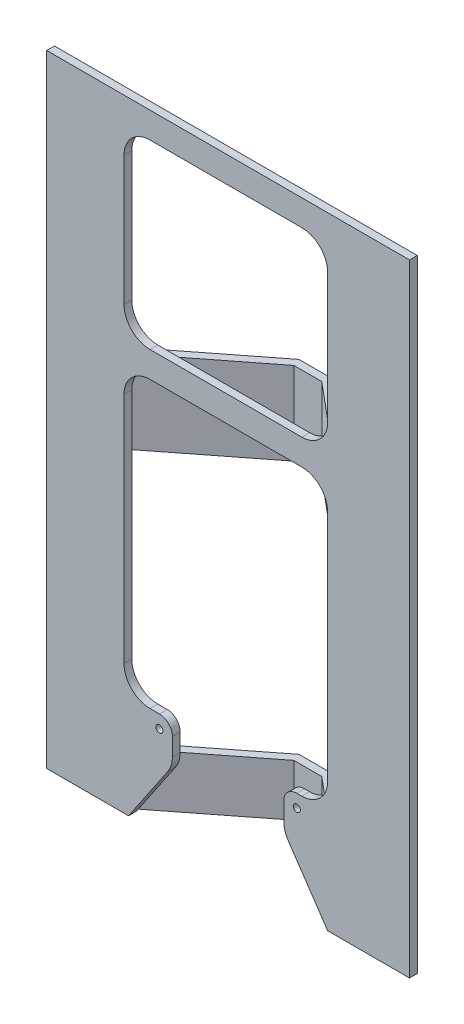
ISO-10303-21;
HEADER;
FILE_DESCRIPTION(('STEP AP214'),'2;1');
FILE_NAME('part.step','',(''),(''),'','','');
FILE_SCHEMA(('AUTOMOTIVE_DESIGN { 1 0 10303 214 1 1 1 1 }'));
ENDSEC;
DATA;
#1=APPLICATION_CONTEXT('core data for automotive mechanical design processes');
#2=APPLICATION_PROTOCOL_DEFINITION('international standard','automotive_design',2000,#1);
#3=PRODUCT_CONTEXT('',#1,'mechanical');
#4=PRODUCT('Part','Part','',(#3));
#5=PRODUCT_RELATED_PRODUCT_CATEGORY('part','',(#4));
#6=PRODUCT_DEFINITION_FORMATION('','',#4);
#7=PRODUCT_DEFINITION_CONTEXT('part definition',#1,'design');
#8=PRODUCT_DEFINITION('design','',#6,#7);
#9=PRODUCT_DEFINITION_SHAPE('','',#8);
#10=(LENGTH_UNIT() NAMED_UNIT(*) SI_UNIT(.MILLI.,.METRE.));
#11=(NAMED_UNIT(*) PLANE_ANGLE_UNIT() SI_UNIT($,.RADIAN.));
#12=(NAMED_UNIT(*) SI_UNIT($,.STERADIAN.) SOLID_ANGLE_UNIT());
#13=UNCERTAINTY_MEASURE_WITH_UNIT(LENGTH_MEASURE(1.E-05),#10,'distance_accuracy_value','');
#14=(GEOMETRIC_REPRESENTATION_CONTEXT(3) GLOBAL_UNCERTAINTY_ASSIGNED_CONTEXT((#13)) GLOBAL_UNIT_ASSIGNED_CONTEXT((#10,
#11,#12)) REPRESENTATION_CONTEXT('',''));
#15=CARTESIAN_POINT('',(0.,0.,0.));
#16=DIRECTION('',(0.,0.,1.));
#17=DIRECTION('',(1.,0.,0.));
#18=AXIS2_PLACEMENT_3D('',#15,#16,#17);
#19=CARTESIAN_POINT('',(-88.9,-304.8,3.81));
#20=DIRECTION('',(1.,0.,0.));
#21=DIRECTION('',(0.,0.,-1.));
#22=AXIS2_PLACEMENT_3D('',#19,#20,#21);
#23=PLANE('',#22);
#24=DIRECTION('',(0.,-1.,0.));
#25=VECTOR('',#24,1.);
#26=CARTESIAN_POINT('',(-88.9,-304.8,0.));
#27=LINE('',#26,#25);
#28=CARTESIAN_POINT('',(-88.9,0.,0.));
#29=VERTEX_POINT('',#28);
#30=CARTESIAN_POINT('',(-88.9,-304.8,0.));
#31=VERTEX_POINT('',#30);
#32=EDGE_CURVE('E707',#29,#31,#27,.T.);
#33=ORIENTED_EDGE('',*,*,#32,.T.);
#34=DIRECTION('',(0.,0.,-1.));
#35=VECTOR('',#34,1.);
#36=CARTESIAN_POINT('',(-88.9,-304.8,3.81));
#37=LINE('',#36,#35);
#38=CARTESIAN_POINT('',(-88.9,-304.8,3.81));
#39=VERTEX_POINT('',#38);
#40=EDGE_CURVE('E752',#39,#31,#37,.T.);
#41=ORIENTED_EDGE('',*,*,#40,.F.);
#42=DIRECTION('',(0.,-1.,0.));
#43=VECTOR('',#42,1.);
#44=CARTESIAN_POINT('',(-88.9,-304.8,3.81));
#45=LINE('',#44,#43);
#46=CARTESIAN_POINT('',(-88.9,0.,3.81));
#47=VERTEX_POINT('',#46);
#48=EDGE_CURVE('E715',#47,#39,#45,.T.);
#49=ORIENTED_EDGE('',*,*,#48,.F.);
#50=DIRECTION('',(0.,0.,-1.));
#51=VECTOR('',#50,1.);
#52=CARTESIAN_POINT('',(-88.9,0.,3.81));
#53=LINE('',#52,#51);
#54=EDGE_CURVE('E730',#47,#29,#53,.T.);
#55=ORIENTED_EDGE('',*,*,#54,.T.);
#56=EDGE_LOOP('',(#33,#41,#49,#55));
#57=FACE_BOUND('',#56,.T.);
#58=ADVANCED_FACE('F43',(#57),#23,.F.);
#59=CARTESIAN_POINT('',(88.9,-304.8,3.81));
#60=DIRECTION('',(0.,1.,0.));
#61=DIRECTION('',(0.,0.,1.));
#62=AXIS2_PLACEMENT_3D('',#59,#60,#61);
#63=PLANE('',#62);
#64=DIRECTION('',(1.,0.,0.));
#65=VECTOR('',#64,1.);
#66=CARTESIAN_POINT('',(88.9,-304.8,0.));
#67=LINE('',#66,#65);
#68=CARTESIAN_POINT('',(-51.0034223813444,-304.8,0.));
#69=VERTEX_POINT('',#68);
#70=CARTESIAN_POINT('',(-48.7994188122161,-304.8,0.));
#71=VERTEX_POINT('',#70);
#72=EDGE_CURVE('E739',#69,#71,#67,.T.);
#73=ORIENTED_EDGE('',*,*,#72,.T.);
#74=DIRECTION('',(0.,0.,-1.));
#75=VECTOR('',#74,1.);
#76=CARTESIAN_POINT('',(-48.7994188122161,-304.8,3.811));
#77=LINE('',#76,#75);
#78=CARTESIAN_POINT('',(-48.7994188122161,-304.8,3.81));
#79=VERTEX_POINT('',#78);
#80=EDGE_CURVE('E562',#79,#71,#77,.T.);
#81=ORIENTED_EDGE('',*,*,#80,.F.);
#82=DIRECTION('',(1.,0.,0.));
#83=VECTOR('',#82,1.);
#84=CARTESIAN_POINT('',(88.9,-304.8,3.81));
#85=LINE('',#84,#83);
#86=EDGE_CURVE('E721',#39,#79,#85,.T.);
#87=ORIENTED_EDGE('',*,*,#86,.F.);
#88=ORIENTED_EDGE('',*,*,#40,.T.);
#89=CARTESIAN_POINT('',(-57.1918882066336,-304.8,0.));
#90=VERTEX_POINT('',#89);
#91=EDGE_CURVE('E735',#31,#90,#67,.T.);
#92=ORIENTED_EDGE('',*,*,#91,.T.);
#93=DIRECTION('',(0.788010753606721,0.,-0.615661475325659));
#94=VECTOR('',#93,1.);
#95=CARTESIAN_POINT('',(-62.0684658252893,-304.8,3.81));
#96=LINE('',#95,#94);
#97=CARTESIAN_POINT('',(-7.73533552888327,-304.8,-38.6396937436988));
#98=VERTEX_POINT('',#97);
#99=EDGE_CURVE('E648',#90,#98,#96,.T.);
#100=ORIENTED_EDGE('',*,*,#99,.T.);
#101=DIRECTION('',(1.,0.,0.));
#102=VECTOR('',#101,1.);
#103=CARTESIAN_POINT('',(-7.73533552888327,-304.8,-38.6396937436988));
#104=LINE('',#103,#102);
#105=CARTESIAN_POINT('',(8.67773275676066,-304.8,-38.6396937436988));
#106=VERTEX_POINT('',#105);
#107=EDGE_CURVE('E693',#98,#106,#104,.T.);
#108=ORIENTED_EDGE('',*,*,#107,.T.);
#109=DIRECTION('',(0.766044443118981,0.,0.642787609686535));
#110=VECTOR('',#109,1.);
#111=CARTESIAN_POINT('',(59.2673077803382,-304.8,3.81));
#112=LINE('',#111,#110);
#113=CARTESIAN_POINT('',(54.7267265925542,-304.8,0.));
#114=VERTEX_POINT('',#113);
#115=EDGE_CURVE('E696',#106,#114,#112,.T.);
#116=ORIENTED_EDGE('',*,*,#115,.T.);
#117=CARTESIAN_POINT('',(88.9,-304.8,0.));
#118=VERTEX_POINT('',#117);
#119=EDGE_CURVE('E734',#114,#118,#67,.T.);
#120=ORIENTED_EDGE('',*,*,#119,.T.);
#121=DIRECTION('',(0.,0.,-1.));
#122=VECTOR('',#121,1.);
#123=CARTESIAN_POINT('',(88.9,-304.8,3.81));
#124=LINE('',#123,#122);
#125=CARTESIAN_POINT('',(88.9,-304.8,3.81));
#126=VERTEX_POINT('',#125);
#127=EDGE_CURVE('E748',#126,#118,#124,.T.);
#128=ORIENTED_EDGE('',*,*,#127,.F.);
#129=CARTESIAN_POINT('',(48.799418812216,-304.8,3.81));
#130=VERTEX_POINT('',#129);
#131=EDGE_CURVE('E719',#130,#126,#85,.T.);
#132=ORIENTED_EDGE('',*,*,#131,.F.);
#133=DIRECTION('',(0.,0.,-1.));
#134=VECTOR('',#133,1.);
#135=CARTESIAN_POINT('',(48.799418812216,-304.8,3.811));
#136=LINE('',#135,#134);
#137=CARTESIAN_POINT('',(48.799418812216,-304.8,0.));
#138=VERTEX_POINT('',#137);
#139=EDGE_CURVE('E564',#130,#138,#136,.T.);
#140=ORIENTED_EDGE('',*,*,#139,.T.);
#141=DIRECTION('',(-0.766044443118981,0.,-0.642787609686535));
#142=VECTOR('',#141,1.);
#143=CARTESIAN_POINT('',(53.34,-304.8,3.81));
#144=LINE('',#143,#142);
#145=CARTESIAN_POINT('',(7.29100616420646,-304.8,-34.8296937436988));
#146=VERTEX_POINT('',#145);
#147=EDGE_CURVE('E698',#138,#146,#144,.T.);
#148=ORIENTED_EDGE('',*,*,#147,.T.);
#149=DIRECTION('',(-1.,0.,0.));
#150=VECTOR('',#149,1.);
#151=CARTESIAN_POINT('',(-6.42344732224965,-304.8,-34.8296937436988));
#152=LINE('',#151,#150);
#153=CARTESIAN_POINT('',(-6.42344732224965,-304.8,-34.8296937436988));
#154=VERTEX_POINT('',#153);
#155=EDGE_CURVE('E700',#146,#154,#152,.T.);
#156=ORIENTED_EDGE('',*,*,#155,.T.);
#157=DIRECTION('',(-0.788010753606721,0.,0.615661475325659));
#158=VECTOR('',#157,1.);
#159=CARTESIAN_POINT('',(-55.88,-304.8,3.81));
#160=LINE('',#159,#158);
#161=EDGE_CURVE('E676',#154,#69,#160,.T.);
#162=ORIENTED_EDGE('',*,*,#161,.T.);
#163=EDGE_LOOP('',(#73,#81,#87,#88,#92,#100,#108,#116,#120,#128,#132,#140,#148,#156,#162));
#164=FACE_BOUND('',#163,.T.);
#165=ADVANCED_FACE('F790',(#164),#63,.F.);
#166=CARTESIAN_POINT('',(88.9,-304.8,3.81));
#167=DIRECTION('',(-1.,0.,0.));
#168=DIRECTION('',(0.,0.,1.));
#169=AXIS2_PLACEMENT_3D('',#166,#167,#168);
#170=PLANE('',#169);
#171=DIRECTION('',(0.,1.,0.));
#172=VECTOR('',#171,1.);
#173=CARTESIAN_POINT('',(88.9,-304.8,0.));
#174=LINE('',#173,#172);
#175=CARTESIAN_POINT('',(88.9,0.,0.));
#176=VERTEX_POINT('',#175);
#177=EDGE_CURVE('E738',#118,#176,#174,.T.);
#178=ORIENTED_EDGE('',*,*,#177,.T.);
#179=DIRECTION('',(0.,0.,-1.));
#180=VECTOR('',#179,1.);
#181=CARTESIAN_POINT('',(88.9,0.,3.81));
#182=LINE('',#181,#180);
#183=CARTESIAN_POINT('',(88.9,0.,3.81));
#184=VERTEX_POINT('',#183);
#185=EDGE_CURVE('E745',#184,#176,#182,.T.);
#186=ORIENTED_EDGE('',*,*,#185,.F.);
#187=DIRECTION('',(0.,1.,0.));
#188=VECTOR('',#187,1.);
#189=CARTESIAN_POINT('',(88.9,-304.8,3.81));
#190=LINE('',#189,#188);
#191=EDGE_CURVE('E724',#126,#184,#190,.T.);
#192=ORIENTED_EDGE('',*,*,#191,.F.);
#193=ORIENTED_EDGE('',*,*,#127,.T.);
#194=EDGE_LOOP('',(#178,#186,#192,#193));
#195=FACE_BOUND('',#194,.T.);
#196=ADVANCED_FACE('F795',(#195),#170,.F.);
#197=CARTESIAN_POINT('',(88.9,0.,3.81));
#198=DIRECTION('',(0.,-1.,0.));
#199=DIRECTION('',(0.,0.,-1.));
#200=AXIS2_PLACEMENT_3D('',#197,#198,#199);
#201=PLANE('',#200);
#202=DIRECTION('',(-1.,0.,0.));
#203=VECTOR('',#202,1.);
#204=CARTESIAN_POINT('',(88.9,0.,0.));
#205=LINE('',#204,#203);
#206=EDGE_CURVE('E720',#176,#29,#205,.T.);
#207=ORIENTED_EDGE('',*,*,#206,.T.);
#208=ORIENTED_EDGE('',*,*,#54,.F.);
#209=DIRECTION('',(-1.,0.,0.));
#210=VECTOR('',#209,1.);
#211=CARTESIAN_POINT('',(88.9,0.,3.81));
#212=LINE('',#211,#210);
#213=EDGE_CURVE('E727',#184,#47,#212,.T.);
#214=ORIENTED_EDGE('',*,*,#213,.F.);
#215=ORIENTED_EDGE('',*,*,#185,.T.);
#216=EDGE_LOOP('',(#207,#208,#214,#215));
#217=FACE_BOUND('',#216,.T.);
#218=ADVANCED_FACE('F811',(#217),#201,.F.);
#219=CARTESIAN_POINT('',(0.,0.,3.81));
#220=DIRECTION('',(0.,0.,1.));
#221=DIRECTION('',(1.,0.,0.));
#222=AXIS2_PLACEMENT_3D('',#219,#220,#221);
#223=PLANE('',#222);
#224=CARTESIAN_POINT('',(-38.3034223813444,-25.4,3.81));
#225=DIRECTION('',(0.,0.,1.));
#226=DIRECTION('',(1.,0.,0.));
#227=AXIS2_PLACEMENT_3D('',#224,#225,#226);
#228=CIRCLE('',#227,12.7);
#229=CARTESIAN_POINT('',(-51.0034223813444,-25.4000000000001,3.81));
#230=VERTEX_POINT('',#229);
#231=CARTESIAN_POINT('',(-38.3034223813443,-12.7,3.81));
#232=VERTEX_POINT('',#231);
#233=EDGE_CURVE('E369',#230,#232,#228,.F.);
#234=ORIENTED_EDGE('',*,*,#233,.T.);
#235=DIRECTION('',(1.,0.,0.));
#236=VECTOR('',#235,1.);
#237=CARTESIAN_POINT('',(36.0994188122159,-12.7,3.81));
#238=LINE('',#237,#236);
#239=CARTESIAN_POINT('',(36.0994188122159,-12.7,3.81));
#240=VERTEX_POINT('',#239);
#241=EDGE_CURVE('E357',#232,#240,#238,.T.);
#242=ORIENTED_EDGE('',*,*,#241,.T.);
#243=CARTESIAN_POINT('',(36.099418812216,-25.4,3.81));
#244=DIRECTION('',(0.,0.,1.));
#245=DIRECTION('',(1.,0.,0.));
#246=AXIS2_PLACEMENT_3D('',#243,#244,#245);
#247=CIRCLE('',#246,12.7);
#248=CARTESIAN_POINT('',(48.799418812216,-25.4,3.81));
#249=VERTEX_POINT('',#248);
#250=EDGE_CURVE('E903',#240,#249,#247,.F.);
#251=ORIENTED_EDGE('',*,*,#250,.T.);
#252=DIRECTION('',(0.,-1.,0.));
#253=VECTOR('',#252,1.);
#254=CARTESIAN_POINT('',(48.799418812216,-88.8999999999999,3.81));
#255=LINE('',#254,#253);
#256=CARTESIAN_POINT('',(48.799418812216,-88.8999999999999,3.81));
#257=VERTEX_POINT('',#256);
#258=EDGE_CURVE('E898',#249,#257,#255,.T.);
#259=ORIENTED_EDGE('',*,*,#258,.T.);
#260=CARTESIAN_POINT('',(36.099418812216,-88.9,3.81));
#261=DIRECTION('',(0.,0.,1.));
#262=DIRECTION('',(1.,0.,0.));
#263=AXIS2_PLACEMENT_3D('',#260,#261,#262);
#264=CIRCLE('',#263,12.7);
#265=CARTESIAN_POINT('',(36.0994188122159,-101.6,3.81));
#266=VERTEX_POINT('',#265);
#267=EDGE_CURVE('E895',#257,#266,#264,.F.);
#268=ORIENTED_EDGE('',*,*,#267,.T.);
#269=DIRECTION('',(-1.,0.,0.));
#270=VECTOR('',#269,1.);
#271=CARTESIAN_POINT('',(-38.3034223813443,-101.6,3.81));
#272=LINE('',#271,#270);
#273=CARTESIAN_POINT('',(-38.3034223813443,-101.6,3.81));
#274=VERTEX_POINT('',#273);
#275=EDGE_CURVE('E892',#266,#274,#272,.T.);
#276=ORIENTED_EDGE('',*,*,#275,.T.);
#277=CARTESIAN_POINT('',(-38.3034223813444,-88.9,3.81));
#278=DIRECTION('',(0.,0.,1.));
#279=DIRECTION('',(1.,0.,0.));
#280=AXIS2_PLACEMENT_3D('',#277,#278,#279);
#281=CIRCLE('',#280,12.7);
#282=CARTESIAN_POINT('',(-51.0034223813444,-88.8999999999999,3.81));
#283=VERTEX_POINT('',#282);
#284=EDGE_CURVE('E385',#274,#283,#281,.F.);
#285=ORIENTED_EDGE('',*,*,#284,.T.);
#286=DIRECTION('',(0.,1.,0.));
#287=VECTOR('',#286,1.);
#288=CARTESIAN_POINT('',(-51.0034223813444,-25.4000000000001,3.81));
#289=LINE('',#288,#287);
#290=EDGE_CURVE('E378',#283,#230,#289,.T.);
#291=ORIENTED_EDGE('',*,*,#290,.T.);
#292=EDGE_LOOP('',(#234,#242,#251,#259,#268,#276,#285,#291));
#293=FACE_BOUND('',#292,.T.);
#294=DIRECTION('',(0.560604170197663,0.828083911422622,0.));
#295=VECTOR('',#294,1.);
#296=CARTESIAN_POINT('',(-48.7994188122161,-304.8,3.81));
#297=LINE('',#296,#295);
#298=CARTESIAN_POINT('',(-29.4883343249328,-276.275063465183,3.81));
#299=VERTEX_POINT('',#298);
#300=EDGE_CURVE('E471',#79,#299,#297,.T.);
#301=ORIENTED_EDGE('',*,*,#300,.T.);
#302=CARTESIAN_POINT('',(-40.0050000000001,-269.155390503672,3.81));
#303=DIRECTION('',(0.,0.,1.));
#304=DIRECTION('',(1.,0.,0.));
#305=AXIS2_PLACEMENT_3D('',#302,#303,#304);
#306=CIRCLE('',#305,12.7);
#307=CARTESIAN_POINT('',(-27.3050000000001,-269.155390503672,3.81));
#308=VERTEX_POINT('',#307);
#309=EDGE_CURVE('E468',#299,#308,#306,.T.);
#310=ORIENTED_EDGE('',*,*,#309,.T.);
#311=DIRECTION('',(0.,1.,0.));
#312=VECTOR('',#311,1.);
#313=CARTESIAN_POINT('',(-27.3050000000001,-260.35,3.81));
#314=LINE('',#313,#312);
#315=CARTESIAN_POINT('',(-27.3050000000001,-260.35,3.81));
#316=VERTEX_POINT('',#315);
#317=EDGE_CURVE('E465',#308,#316,#314,.T.);
#318=ORIENTED_EDGE('',*,*,#317,.T.);
#319=CARTESIAN_POINT('',(-33.6550000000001,-260.35,3.81));
#320=DIRECTION('',(0.,0.,1.));
#321=DIRECTION('',(1.,0.,0.));
#322=AXIS2_PLACEMENT_3D('',#319,#320,#321);
#323=CIRCLE('',#322,6.35000000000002);
#324=CARTESIAN_POINT('',(-33.6550000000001,-254.,3.81));
#325=VERTEX_POINT('',#324);
#326=EDGE_CURVE('E462',#316,#325,#323,.T.);
#327=ORIENTED_EDGE('',*,*,#326,.T.);
#328=DIRECTION('',(-1.,0.,0.));
#329=VECTOR('',#328,1.);
#330=CARTESIAN_POINT('',(-38.3034223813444,-254.,3.81));
#331=LINE('',#330,#329);
#332=CARTESIAN_POINT('',(-38.3034223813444,-254.,3.81));
#333=VERTEX_POINT('',#332);
#334=EDGE_CURVE('E459',#325,#333,#331,.T.);
#335=ORIENTED_EDGE('',*,*,#334,.T.);
#336=CARTESIAN_POINT('',(-38.3034223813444,-241.3,3.81));
#337=DIRECTION('',(0.,0.,1.));
#338=DIRECTION('',(1.,0.,0.));
#339=AXIS2_PLACEMENT_3D('',#336,#337,#338);
#340=CIRCLE('',#339,12.7);
#341=CARTESIAN_POINT('',(-51.0034223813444,-241.3,3.81));
#342=VERTEX_POINT('',#341);
#343=EDGE_CURVE('E456',#333,#342,#340,.F.);
#344=ORIENTED_EDGE('',*,*,#343,.T.);
#345=DIRECTION('',(0.,1.,0.));
#346=VECTOR('',#345,1.);
#347=CARTESIAN_POINT('',(-51.0034223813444,-127.,3.81));
#348=LINE('',#347,#346);
#349=CARTESIAN_POINT('',(-51.0034223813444,-127.,3.81));
#350=VERTEX_POINT('',#349);
#351=EDGE_CURVE('E452',#342,#350,#348,.T.);
#352=ORIENTED_EDGE('',*,*,#351,.T.);
#353=CARTESIAN_POINT('',(-38.3034223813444,-127.,3.81));
#354=DIRECTION('',(0.,0.,1.));
#355=DIRECTION('',(1.,0.,0.));
#356=AXIS2_PLACEMENT_3D('',#353,#354,#355);
#357=CIRCLE('',#356,12.7);
#358=CARTESIAN_POINT('',(-38.3034223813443,-114.3,3.81));
#359=VERTEX_POINT('',#358);
#360=EDGE_CURVE('E448',#350,#359,#357,.F.);
#361=ORIENTED_EDGE('',*,*,#360,.T.);
#362=DIRECTION('',(1.,0.,0.));
#363=VECTOR('',#362,1.);
#364=CARTESIAN_POINT('',(-38.3034223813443,-114.3,3.81));
#365=LINE('',#364,#363);
#366=CARTESIAN_POINT('',(36.0994188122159,-114.3,3.81));
#367=VERTEX_POINT('',#366);
#368=EDGE_CURVE('E444',#359,#367,#365,.T.);
#369=ORIENTED_EDGE('',*,*,#368,.T.);
#370=CARTESIAN_POINT('',(36.099418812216,-127.,3.81));
#371=DIRECTION('',(0.,0.,1.));
#372=DIRECTION('',(1.,0.,0.));
#373=AXIS2_PLACEMENT_3D('',#370,#371,#372);
#374=CIRCLE('',#373,12.7);
#375=CARTESIAN_POINT('',(48.799418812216,-127.,3.81));
#376=VERTEX_POINT('',#375);
#377=EDGE_CURVE('E441',#367,#376,#374,.F.);
#378=ORIENTED_EDGE('',*,*,#377,.T.);
#379=DIRECTION('',(0.,-1.,0.));
#380=VECTOR('',#379,1.);
#381=CARTESIAN_POINT('',(48.799418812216,-241.3,3.81));
#382=LINE('',#381,#380);
#383=CARTESIAN_POINT('',(48.799418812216,-241.3,3.81));
#384=VERTEX_POINT('',#383);
#385=EDGE_CURVE('E437',#376,#384,#382,.T.);
#386=ORIENTED_EDGE('',*,*,#385,.T.);
#387=CARTESIAN_POINT('',(36.099418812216,-241.3,3.81));
#388=DIRECTION('',(0.,0.,1.));
#389=DIRECTION('',(1.,0.,0.));
#390=AXIS2_PLACEMENT_3D('',#387,#388,#389);
#391=CIRCLE('',#390,12.7);
#392=CARTESIAN_POINT('',(36.099418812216,-254.,3.81));
#393=VERTEX_POINT('',#392);
#394=EDGE_CURVE('E434',#384,#393,#391,.F.);
#395=ORIENTED_EDGE('',*,*,#394,.T.);
#396=DIRECTION('',(-1.,0.,0.));
#397=VECTOR('',#396,1.);
#398=CARTESIAN_POINT('',(33.655,-254.,3.81));
#399=LINE('',#398,#397);
#400=CARTESIAN_POINT('',(33.655,-254.,3.81));
#401=VERTEX_POINT('',#400);
#402=EDGE_CURVE('E431',#393,#401,#399,.T.);
#403=ORIENTED_EDGE('',*,*,#402,.T.);
#404=CARTESIAN_POINT('',(33.655,-260.35,3.81));
#405=DIRECTION('',(0.,0.,1.));
#406=DIRECTION('',(1.,0.,0.));
#407=AXIS2_PLACEMENT_3D('',#404,#405,#406);
#408=CIRCLE('',#407,6.35000000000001);
#409=CARTESIAN_POINT('',(27.305,-260.35,3.81));
#410=VERTEX_POINT('',#409);
#411=EDGE_CURVE('E428',#401,#410,#408,.T.);
#412=ORIENTED_EDGE('',*,*,#411,.T.);
#413=DIRECTION('',(0.,-1.,0.));
#414=VECTOR('',#413,1.);
#415=CARTESIAN_POINT('',(27.305,-260.35,3.81));
#416=LINE('',#415,#414);
#417=CARTESIAN_POINT('',(27.305,-269.155390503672,3.81));
#418=VERTEX_POINT('',#417);
#419=EDGE_CURVE('E532',#410,#418,#416,.T.);
#420=ORIENTED_EDGE('',*,*,#419,.T.);
#421=CARTESIAN_POINT('',(40.005,-269.155390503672,3.81));
#422=DIRECTION('',(0.,0.,1.));
#423=DIRECTION('',(1.,0.,0.));
#424=AXIS2_PLACEMENT_3D('',#421,#422,#423);
#425=CIRCLE('',#424,12.7);
#426=CARTESIAN_POINT('',(29.4883343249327,-276.275063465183,3.81));
#427=VERTEX_POINT('',#426);
#428=EDGE_CURVE('E365',#418,#427,#425,.T.);
#429=ORIENTED_EDGE('',*,*,#428,.T.);
#430=DIRECTION('',(0.560604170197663,-0.828083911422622,0.));
#431=VECTOR('',#430,1.);
#432=CARTESIAN_POINT('',(48.799418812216,-304.8,3.81));
#433=LINE('',#432,#431);
#434=EDGE_CURVE('E425',#427,#130,#433,.T.);
#435=ORIENTED_EDGE('',*,*,#434,.T.);
#436=ORIENTED_EDGE('',*,*,#131,.T.);
#437=ORIENTED_EDGE('',*,*,#191,.T.);
#438=ORIENTED_EDGE('',*,*,#213,.T.);
#439=ORIENTED_EDGE('',*,*,#48,.T.);
#440=ORIENTED_EDGE('',*,*,#86,.T.);
#441=EDGE_LOOP('',(#301,#310,#318,#327,#335,#344,#352,#361,#369,#378,#386,#395,#403,#412,#420,
#429,#435,#436,#437,#438,#439,#440));
#442=FACE_BOUND('',#441,.T.);
#443=CARTESIAN_POINT('',(-33.655,-260.35,3.81));
#444=DIRECTION('',(0.,0.,1.));
#445=DIRECTION('',(1.,0.,0.));
#446=AXIS2_PLACEMENT_3D('',#443,#444,#445);
#447=CIRCLE('',#446,1.72719999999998);
#448=CARTESIAN_POINT('',(-31.9278,-260.35,3.81));
#449=VERTEX_POINT('',#448);
#450=EDGE_CURVE('E574',#449,#449,#447,.T.);
#451=ORIENTED_EDGE('',*,*,#450,.F.);
#452=EDGE_LOOP('',(#451));
#453=FACE_BOUND('',#452,.T.);
#454=CARTESIAN_POINT('',(33.655,-260.35,3.81));
#455=DIRECTION('',(0.,0.,1.));
#456=DIRECTION('',(1.,0.,0.));
#457=AXIS2_PLACEMENT_3D('',#454,#455,#456);
#458=CIRCLE('',#457,1.72719999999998);
#459=CARTESIAN_POINT('',(35.3822,-260.35,3.81));
#460=VERTEX_POINT('',#459);
#461=EDGE_CURVE('E577',#460,#460,#458,.T.);
#462=ORIENTED_EDGE('',*,*,#461,.F.);
#463=EDGE_LOOP('',(#462));
#464=FACE_BOUND('',#463,.T.);
#465=ADVANCED_FACE('F375',(#293,#442,#453,#464),#223,.T.);
#466=CARTESIAN_POINT('',(0.,0.,0.));
#467=DIRECTION('',(0.,0.,1.));
#468=DIRECTION('',(1.,0.,0.));
#469=AXIS2_PLACEMENT_3D('',#466,#467,#468);
#470=PLANE('',#469);
#471=DIRECTION('',(1.,0.,0.));
#472=VECTOR('',#471,1.);
#473=CARTESIAN_POINT('',(36.0994188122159,-12.7,0.));
#474=LINE('',#473,#472);
#475=CARTESIAN_POINT('',(-38.3034223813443,-12.7,0.));
#476=VERTEX_POINT('',#475);
#477=CARTESIAN_POINT('',(36.0994188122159,-12.7,0.));
#478=VERTEX_POINT('',#477);
#479=EDGE_CURVE('E383',#476,#478,#474,.T.);
#480=ORIENTED_EDGE('',*,*,#479,.F.);
#481=CARTESIAN_POINT('',(-38.3034223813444,-25.4,0.));
#482=DIRECTION('',(0.,0.,-1.));
#483=DIRECTION('',(1.,0.,0.));
#484=AXIS2_PLACEMENT_3D('',#481,#482,#483);
#485=CIRCLE('',#484,12.7);
#486=CARTESIAN_POINT('',(-51.0034223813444,-25.4000000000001,0.));
#487=VERTEX_POINT('',#486);
#488=EDGE_CURVE('E70',#487,#476,#485,.T.);
#489=ORIENTED_EDGE('',*,*,#488,.F.);
#490=DIRECTION('',(0.,1.,0.));
#491=VECTOR('',#490,1.);
#492=CARTESIAN_POINT('',(-51.0034223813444,-25.4000000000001,0.));
#493=LINE('',#492,#491);
#494=CARTESIAN_POINT('',(-51.0034223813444,-88.8999999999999,0.));
#495=VERTEX_POINT('',#494);
#496=EDGE_CURVE('E372',#495,#487,#493,.T.);
#497=ORIENTED_EDGE('',*,*,#496,.F.);
#498=CARTESIAN_POINT('',(-38.3034223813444,-88.9,0.));
#499=DIRECTION('',(0.,0.,-1.));
#500=DIRECTION('',(-1.,0.,0.));
#501=AXIS2_PLACEMENT_3D('',#498,#499,#500);
#502=CIRCLE('',#501,12.7);
#503=CARTESIAN_POINT('',(-38.3034223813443,-101.6,0.));
#504=VERTEX_POINT('',#503);
#505=EDGE_CURVE('E404',#504,#495,#502,.T.);
#506=ORIENTED_EDGE('',*,*,#505,.F.);
#507=DIRECTION('',(-1.,0.,0.));
#508=VECTOR('',#507,1.);
#509=CARTESIAN_POINT('',(-38.3034223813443,-101.6,0.));
#510=LINE('',#509,#508);
#511=CARTESIAN_POINT('',(36.0994188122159,-101.6,0.));
#512=VERTEX_POINT('',#511);
#513=EDGE_CURVE('E400',#512,#504,#510,.T.);
#514=ORIENTED_EDGE('',*,*,#513,.F.);
#515=CARTESIAN_POINT('',(36.099418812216,-88.9,0.));
#516=DIRECTION('',(0.,0.,-1.));
#517=DIRECTION('',(1.,0.,0.));
#518=AXIS2_PLACEMENT_3D('',#515,#516,#517);
#519=CIRCLE('',#518,12.7);
#520=CARTESIAN_POINT('',(48.799418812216,-88.8999999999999,0.));
#521=VERTEX_POINT('',#520);
#522=EDGE_CURVE('E397',#521,#512,#519,.T.);
#523=ORIENTED_EDGE('',*,*,#522,.F.);
#524=DIRECTION('',(0.,-1.,0.));
#525=VECTOR('',#524,1.);
#526=CARTESIAN_POINT('',(48.799418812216,-88.8999999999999,0.));
#527=LINE('',#526,#525);
#528=CARTESIAN_POINT('',(48.799418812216,-25.4000000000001,0.));
#529=VERTEX_POINT('',#528);
#530=EDGE_CURVE('E394',#529,#521,#527,.T.);
#531=ORIENTED_EDGE('',*,*,#530,.F.);
#532=CARTESIAN_POINT('',(36.099418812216,-25.4,0.));
#533=DIRECTION('',(0.,0.,-1.));
#534=DIRECTION('',(1.,0.,0.));
#535=AXIS2_PLACEMENT_3D('',#532,#533,#534);
#536=CIRCLE('',#535,12.7);
#537=EDGE_CURVE('E391',#478,#529,#536,.T.);
#538=ORIENTED_EDGE('',*,*,#537,.F.);
#539=EDGE_LOOP('',(#480,#489,#497,#506,#514,#523,#531,#538));
#540=FACE_BOUND('',#539,.T.);
#541=CARTESIAN_POINT('',(-33.655,-260.35,0.));
#542=DIRECTION('',(0.,0.,1.));
#543=DIRECTION('',(1.,0.,0.));
#544=AXIS2_PLACEMENT_3D('',#541,#542,#543);
#545=CIRCLE('',#544,1.72719999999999);
#546=CARTESIAN_POINT('',(-31.9278,-260.35,0.));
#547=VERTEX_POINT('',#546);
#548=EDGE_CURVE('E46',#547,#547,#545,.T.);
#549=ORIENTED_EDGE('',*,*,#548,.T.);
#550=EDGE_LOOP('',(#549));
#551=FACE_BOUND('',#550,.T.);
#552=CARTESIAN_POINT('',(33.655,-260.35,0.));
#553=DIRECTION('',(0.,0.,1.));
#554=DIRECTION('',(1.,0.,0.));
#555=AXIS2_PLACEMENT_3D('',#552,#553,#554);
#556=CIRCLE('',#555,1.72719999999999);
#557=CARTESIAN_POINT('',(35.3822,-260.35,0.));
#558=VERTEX_POINT('',#557);
#559=EDGE_CURVE('E580',#558,#558,#556,.T.);
#560=ORIENTED_EDGE('',*,*,#559,.T.);
#561=EDGE_LOOP('',(#560));
#562=FACE_BOUND('',#561,.T.);
#563=DIRECTION('',(0.,1.,0.));
#564=VECTOR('',#563,1.);
#565=CARTESIAN_POINT('',(48.799418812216,-152.4,0.));
#566=LINE('',#565,#564);
#567=CARTESIAN_POINT('',(48.799418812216,-127.,0.));
#568=VERTEX_POINT('',#567);
#569=CARTESIAN_POINT('',(48.799418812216,-111.76,0.));
#570=VERTEX_POINT('',#569);
#571=EDGE_CURVE('E613',#568,#570,#566,.T.);
#572=ORIENTED_EDGE('',*,*,#571,.F.);
#573=CARTESIAN_POINT('',(36.099418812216,-127.,0.));
#574=DIRECTION('',(0.,0.,-1.));
#575=DIRECTION('',(-1.,0.,0.));
#576=AXIS2_PLACEMENT_3D('',#573,#574,#575);
#577=CIRCLE('',#576,12.7);
#578=CARTESIAN_POINT('',(36.0994188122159,-114.3,0.));
#579=VERTEX_POINT('',#578);
#580=EDGE_CURVE('E517',#579,#568,#577,.T.);
#581=ORIENTED_EDGE('',*,*,#580,.F.);
#582=DIRECTION('',(1.,0.,0.));
#583=VECTOR('',#582,1.);
#584=CARTESIAN_POINT('',(-38.3034223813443,-114.3,0.));
#585=LINE('',#584,#583);
#586=CARTESIAN_POINT('',(-38.3034223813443,-114.3,0.));
#587=VERTEX_POINT('',#586);
#588=EDGE_CURVE('E513',#587,#579,#585,.T.);
#589=ORIENTED_EDGE('',*,*,#588,.F.);
#590=CARTESIAN_POINT('',(-38.3034223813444,-127.,0.));
#591=DIRECTION('',(0.,0.,-1.));
#592=DIRECTION('',(-1.,0.,0.));
#593=AXIS2_PLACEMENT_3D('',#590,#591,#592);
#594=CIRCLE('',#593,12.7);
#595=CARTESIAN_POINT('',(-51.0034223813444,-127.,0.));
#596=VERTEX_POINT('',#595);
#597=EDGE_CURVE('E509',#596,#587,#594,.T.);
#598=ORIENTED_EDGE('',*,*,#597,.F.);
#599=DIRECTION('',(0.,1.,0.));
#600=VECTOR('',#599,1.);
#601=CARTESIAN_POINT('',(-51.0034223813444,-152.4,0.));
#602=LINE('',#601,#600);
#603=CARTESIAN_POINT('',(-51.0034223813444,-111.76,0.));
#604=VERTEX_POINT('',#603);
#605=EDGE_CURVE('E655',#596,#604,#602,.T.);
#606=ORIENTED_EDGE('',*,*,#605,.T.);
#607=DIRECTION('',(1.,0.,0.));
#608=VECTOR('',#607,1.);
#609=CARTESIAN_POINT('',(-57.1918882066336,-111.76,0.));
#610=LINE('',#609,#608);
#611=CARTESIAN_POINT('',(-57.1918882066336,-111.76,0.));
#612=VERTEX_POINT('',#611);
#613=EDGE_CURVE('E634',#612,#604,#610,.T.);
#614=ORIENTED_EDGE('',*,*,#613,.F.);
#615=DIRECTION('',(0.,1.,0.));
#616=VECTOR('',#615,1.);
#617=CARTESIAN_POINT('',(-57.1918882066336,-152.4,0.));
#618=LINE('',#617,#616);
#619=CARTESIAN_POINT('',(-57.1918882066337,-152.4,0.));
#620=VERTEX_POINT('',#619);
#621=EDGE_CURVE('E656',#620,#612,#618,.T.);
#622=ORIENTED_EDGE('',*,*,#621,.F.);
#623=DIRECTION('',(1.,0.,0.));
#624=VECTOR('',#623,1.);
#625=CARTESIAN_POINT('',(-57.1918882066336,-152.4,0.));
#626=LINE('',#625,#624);
#627=CARTESIAN_POINT('',(-51.0034223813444,-152.4,0.));
#628=VERTEX_POINT('',#627);
#629=EDGE_CURVE('E601',#620,#628,#626,.T.);
#630=ORIENTED_EDGE('',*,*,#629,.T.);
#631=DIRECTION('',(0.,1.,0.));
#632=VECTOR('',#631,1.);
#633=CARTESIAN_POINT('',(-51.0034223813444,-127.,0.));
#634=LINE('',#633,#632);
#635=CARTESIAN_POINT('',(-51.0034223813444,-241.3,0.));
#636=VERTEX_POINT('',#635);
#637=EDGE_CURVE('E506',#636,#628,#634,.T.);
#638=ORIENTED_EDGE('',*,*,#637,.F.);
#639=CARTESIAN_POINT('',(-38.3034223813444,-241.3,0.));
#640=DIRECTION('',(0.,0.,-1.));
#641=DIRECTION('',(1.,0.,0.));
#642=AXIS2_PLACEMENT_3D('',#639,#640,#641);
#643=CIRCLE('',#642,12.7);
#644=CARTESIAN_POINT('',(-38.3034223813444,-254.,0.));
#645=VERTEX_POINT('',#644);
#646=EDGE_CURVE('E503',#645,#636,#643,.T.);
#647=ORIENTED_EDGE('',*,*,#646,.F.);
#648=DIRECTION('',(-1.,0.,0.));
#649=VECTOR('',#648,1.);
#650=CARTESIAN_POINT('',(-38.3034223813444,-254.,0.));
#651=LINE('',#650,#649);
#652=CARTESIAN_POINT('',(-33.6550000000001,-254.,0.));
#653=VERTEX_POINT('',#652);
#654=EDGE_CURVE('E500',#653,#645,#651,.T.);
#655=ORIENTED_EDGE('',*,*,#654,.F.);
#656=CARTESIAN_POINT('',(-33.6550000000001,-260.35,0.));
#657=DIRECTION('',(0.,0.,1.));
#658=DIRECTION('',(-1.,0.,0.));
#659=AXIS2_PLACEMENT_3D('',#656,#657,#658);
#660=CIRCLE('',#659,6.35000000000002);
#661=CARTESIAN_POINT('',(-27.3050000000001,-260.35,0.));
#662=VERTEX_POINT('',#661);
#663=EDGE_CURVE('E497',#662,#653,#660,.T.);
#664=ORIENTED_EDGE('',*,*,#663,.F.);
#665=DIRECTION('',(0.,1.,0.));
#666=VECTOR('',#665,1.);
#667=CARTESIAN_POINT('',(-27.3050000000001,-260.35,0.));
#668=LINE('',#667,#666);
#669=CARTESIAN_POINT('',(-27.3050000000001,-269.155390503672,0.));
#670=VERTEX_POINT('',#669);
#671=EDGE_CURVE('E494',#670,#662,#668,.T.);
#672=ORIENTED_EDGE('',*,*,#671,.F.);
#673=CARTESIAN_POINT('',(-40.0050000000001,-269.155390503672,0.));
#674=DIRECTION('',(0.,0.,1.));
#675=DIRECTION('',(-1.,0.,0.));
#676=AXIS2_PLACEMENT_3D('',#673,#674,#675);
#677=CIRCLE('',#676,12.7);
#678=CARTESIAN_POINT('',(-29.4883343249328,-276.275063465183,0.));
#679=VERTEX_POINT('',#678);
#680=EDGE_CURVE('E490',#679,#670,#677,.T.);
#681=ORIENTED_EDGE('',*,*,#680,.F.);
#682=DIRECTION('',(0.560604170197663,0.828083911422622,0.));
#683=VECTOR('',#682,1.);
#684=CARTESIAN_POINT('',(-48.7994188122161,-304.8,0.));
#685=LINE('',#684,#683);
#686=EDGE_CURVE('E486',#71,#679,#685,.T.);
#687=ORIENTED_EDGE('',*,*,#686,.F.);
#688=ORIENTED_EDGE('',*,*,#72,.F.);
#689=DIRECTION('',(0.,1.,0.));
#690=VECTOR('',#689,1.);
#691=CARTESIAN_POINT('',(-51.0034223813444,0.,0.));
#692=LINE('',#691,#690);
#693=CARTESIAN_POINT('',(-51.0034223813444,-279.4,0.));
#694=VERTEX_POINT('',#693);
#695=EDGE_CURVE('E758',#69,#694,#692,.T.);
#696=ORIENTED_EDGE('',*,*,#695,.T.);
#697=DIRECTION('',(-1.,0.,0.));
#698=VECTOR('',#697,1.);
#699=CARTESIAN_POINT('',(0.,-279.4,0.));
#700=LINE('',#699,#698);
#701=CARTESIAN_POINT('',(-57.1918882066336,-279.4,0.));
#702=VERTEX_POINT('',#701);
#703=EDGE_CURVE('E755',#694,#702,#700,.T.);
#704=ORIENTED_EDGE('',*,*,#703,.T.);
#705=DIRECTION('',(0.,-1.,0.));
#706=VECTOR('',#705,1.);
#707=CARTESIAN_POINT('',(-57.1918882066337,0.,0.));
#708=LINE('',#707,#706);
#709=EDGE_CURVE('E762',#702,#90,#708,.T.);
#710=ORIENTED_EDGE('',*,*,#709,.T.);
#711=ORIENTED_EDGE('',*,*,#91,.F.);
#712=ORIENTED_EDGE('',*,*,#32,.F.);
#713=ORIENTED_EDGE('',*,*,#206,.F.);
#714=ORIENTED_EDGE('',*,*,#177,.F.);
#715=ORIENTED_EDGE('',*,*,#119,.F.);
#716=DIRECTION('',(0.,1.,0.));
#717=VECTOR('',#716,1.);
#718=CARTESIAN_POINT('',(54.7267265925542,0.,0.));
#719=LINE('',#718,#717);
#720=CARTESIAN_POINT('',(54.7267265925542,-279.4,0.));
#721=VERTEX_POINT('',#720);
#722=EDGE_CURVE('E51',#114,#721,#719,.T.);
#723=ORIENTED_EDGE('',*,*,#722,.T.);
#724=CARTESIAN_POINT('',(48.799418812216,-279.4,0.));
#725=VERTEX_POINT('',#724);
#726=EDGE_CURVE('E759',#721,#725,#700,.T.);
#727=ORIENTED_EDGE('',*,*,#726,.T.);
#728=DIRECTION('',(0.,-1.,0.));
#729=VECTOR('',#728,1.);
#730=CARTESIAN_POINT('',(48.799418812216,0.,0.));
#731=LINE('',#730,#729);
#732=EDGE_CURVE('E11',#725,#138,#731,.T.);
#733=ORIENTED_EDGE('',*,*,#732,.T.);
#734=DIRECTION('',(0.560604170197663,-0.828083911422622,0.));
#735=VECTOR('',#734,1.);
#736=CARTESIAN_POINT('',(48.799418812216,-304.8,0.));
#737=LINE('',#736,#735);
#738=CARTESIAN_POINT('',(29.4883343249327,-276.275063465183,0.));
#739=VERTEX_POINT('',#738);
#740=EDGE_CURVE('E484',#739,#138,#737,.T.);
#741=ORIENTED_EDGE('',*,*,#740,.F.);
#742=CARTESIAN_POINT('',(40.005,-269.155390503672,0.));
#743=DIRECTION('',(0.,0.,1.));
#744=DIRECTION('',(1.,0.,0.));
#745=AXIS2_PLACEMENT_3D('',#742,#743,#744);
#746=CIRCLE('',#745,12.7);
#747=CARTESIAN_POINT('',(27.305,-269.155390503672,0.));
#748=VERTEX_POINT('',#747);
#749=EDGE_CURVE('E481',#748,#739,#746,.T.);
#750=ORIENTED_EDGE('',*,*,#749,.F.);
#751=DIRECTION('',(0.,-1.,0.));
#752=VECTOR('',#751,1.);
#753=CARTESIAN_POINT('',(27.305,-260.35,0.));
#754=LINE('',#753,#752);
#755=CARTESIAN_POINT('',(27.305,-260.35,0.));
#756=VERTEX_POINT('',#755);
#757=EDGE_CURVE('E478',#756,#748,#754,.T.);
#758=ORIENTED_EDGE('',*,*,#757,.F.);
#759=CARTESIAN_POINT('',(33.655,-260.35,0.));
#760=DIRECTION('',(0.,0.,1.));
#761=DIRECTION('',(1.,0.,0.));
#762=AXIS2_PLACEMENT_3D('',#759,#760,#761);
#763=CIRCLE('',#762,6.35000000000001);
#764=CARTESIAN_POINT('',(33.655,-254.,0.));
#765=VERTEX_POINT('',#764);
#766=EDGE_CURVE('E475',#765,#756,#763,.T.);
#767=ORIENTED_EDGE('',*,*,#766,.F.);
#768=DIRECTION('',(-1.,0.,0.));
#769=VECTOR('',#768,1.);
#770=CARTESIAN_POINT('',(33.655,-254.,0.));
#771=LINE('',#770,#769);
#772=CARTESIAN_POINT('',(36.099418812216,-254.,0.));
#773=VERTEX_POINT('',#772);
#774=EDGE_CURVE('E526',#773,#765,#771,.T.);
#775=ORIENTED_EDGE('',*,*,#774,.F.);
#776=CARTESIAN_POINT('',(36.099418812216,-241.3,0.));
#777=DIRECTION('',(0.,0.,-1.));
#778=DIRECTION('',(1.,0.,0.));
#779=AXIS2_PLACEMENT_3D('',#776,#777,#778);
#780=CIRCLE('',#779,12.7);
#781=CARTESIAN_POINT('',(48.799418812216,-241.3,0.));
#782=VERTEX_POINT('',#781);
#783=EDGE_CURVE('E523',#782,#773,#780,.T.);
#784=ORIENTED_EDGE('',*,*,#783,.F.);
#785=DIRECTION('',(0.,-1.,0.));
#786=VECTOR('',#785,1.);
#787=CARTESIAN_POINT('',(48.799418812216,-241.3,0.));
#788=LINE('',#787,#786);
#789=CARTESIAN_POINT('',(48.799418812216,-152.4,0.));
#790=VERTEX_POINT('',#789);
#791=EDGE_CURVE('E520',#790,#782,#788,.T.);
#792=ORIENTED_EDGE('',*,*,#791,.F.);
#793=DIRECTION('',(1.,0.,0.));
#794=VECTOR('',#793,1.);
#795=CARTESIAN_POINT('',(48.799418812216,-152.4,0.));
#796=LINE('',#795,#794);
#797=CARTESIAN_POINT('',(54.7267265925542,-152.4,0.));
#798=VERTEX_POINT('',#797);
#799=EDGE_CURVE('E585',#790,#798,#796,.T.);
#800=ORIENTED_EDGE('',*,*,#799,.T.);
#801=DIRECTION('',(0.,1.,0.));
#802=VECTOR('',#801,1.);
#803=CARTESIAN_POINT('',(54.7267265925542,-152.4,0.));
#804=LINE('',#803,#802);
#805=CARTESIAN_POINT('',(54.7267265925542,-111.76,0.));
#806=VERTEX_POINT('',#805);
#807=EDGE_CURVE('E666',#798,#806,#804,.T.);
#808=ORIENTED_EDGE('',*,*,#807,.T.);
#809=DIRECTION('',(1.,0.,0.));
#810=VECTOR('',#809,1.);
#811=CARTESIAN_POINT('',(48.799418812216,-111.76,0.));
#812=LINE('',#811,#810);
#813=EDGE_CURVE('E618',#570,#806,#812,.T.);
#814=ORIENTED_EDGE('',*,*,#813,.F.);
#815=EDGE_LOOP('',(#572,#581,#589,#598,#606,#614,#622,#630,#638,#647,#655,#664,#672,#681,#687,
#688,#696,#704,#710,#711,#712,#713,#714,#715,#723,#727,#733,#741,#750,#758,#767,#775,#784,#792,
#800,#808,#814));
#816=FACE_BOUND('',#815,.T.);
#817=ADVANCED_FACE('F769',(#540,#551,#562,#816),#470,.F.);
#818=CARTESIAN_POINT('',(-62.0684658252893,-279.4,3.81));
#819=DIRECTION('',(-0.615661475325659,0.,-0.788010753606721));
#820=DIRECTION('',(-0.788010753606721,0.,0.615661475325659));
#821=AXIS2_PLACEMENT_3D('',#818,#819,#820);
#822=PLANE('',#821);
#823=ORIENTED_EDGE('',*,*,#709,.F.);
#824=DIRECTION('',(0.788010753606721,0.,-0.615661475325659));
#825=VECTOR('',#824,1.);
#826=CARTESIAN_POINT('',(-62.0684658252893,-279.4,3.81));
#827=LINE('',#826,#825);
#828=CARTESIAN_POINT('',(-7.73533552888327,-279.4,-38.6396937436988));
#829=VERTEX_POINT('',#828);
#830=EDGE_CURVE('E673',#702,#829,#827,.T.);
#831=ORIENTED_EDGE('',*,*,#830,.T.);
#832=DIRECTION('',(0.,-1.,0.));
#833=VECTOR('',#832,1.);
#834=CARTESIAN_POINT('',(-7.73533552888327,-279.4,-38.6396937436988));
#835=LINE('',#834,#833);
#836=EDGE_CURVE('E691',#829,#98,#835,.T.);
#837=ORIENTED_EDGE('',*,*,#836,.T.);
#838=ORIENTED_EDGE('',*,*,#99,.F.);
#839=EDGE_LOOP('',(#823,#831,#837,#838));
#840=FACE_BOUND('',#839,.T.);
#841=ADVANCED_FACE('F930',(#840),#822,.T.);
#842=CARTESIAN_POINT('',(-55.88,-279.4,3.81));
#843=DIRECTION('',(0.615661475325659,0.,0.788010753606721));
#844=DIRECTION('',(0.788010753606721,0.,-0.61566147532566));
#845=AXIS2_PLACEMENT_3D('',#842,#843,#844);
#846=PLANE('',#845);
#847=ORIENTED_EDGE('',*,*,#695,.F.);
#848=ORIENTED_EDGE('',*,*,#161,.F.);
#849=DIRECTION('',(0.,-1.,0.));
#850=VECTOR('',#849,1.);
#851=CARTESIAN_POINT('',(-6.42344732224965,-279.4,-34.8296937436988));
#852=LINE('',#851,#850);
#853=CARTESIAN_POINT('',(-6.42344732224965,-279.4,-34.8296937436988));
#854=VERTEX_POINT('',#853);
#855=EDGE_CURVE('E705',#854,#154,#852,.T.);
#856=ORIENTED_EDGE('',*,*,#855,.F.);
#857=DIRECTION('',(-0.788010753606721,0.,0.615661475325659));
#858=VECTOR('',#857,1.);
#859=CARTESIAN_POINT('',(-55.88,-279.4,3.81));
#860=LINE('',#859,#858);
#861=EDGE_CURVE('E687',#854,#694,#860,.T.);
#862=ORIENTED_EDGE('',*,*,#861,.T.);
#863=EDGE_LOOP('',(#847,#848,#856,#862));
#864=FACE_BOUND('',#863,.T.);
#865=ADVANCED_FACE('F939',(#864),#846,.T.);
#866=CARTESIAN_POINT('',(53.34,-279.4,3.81));
#867=DIRECTION('',(-0.642787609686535,0.,0.766044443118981));
#868=DIRECTION('',(0.766044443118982,0.,0.642787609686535));
#869=AXIS2_PLACEMENT_3D('',#866,#867,#868);
#870=PLANE('',#869);
#871=ORIENTED_EDGE('',*,*,#732,.F.);
#872=DIRECTION('',(-0.766044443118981,0.,-0.642787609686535));
#873=VECTOR('',#872,1.);
#874=CARTESIAN_POINT('',(53.34,-279.4,3.81));
#875=LINE('',#874,#873);
#876=CARTESIAN_POINT('',(7.29100616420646,-279.4,-34.8296937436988));
#877=VERTEX_POINT('',#876);
#878=EDGE_CURVE('E682',#725,#877,#875,.T.);
#879=ORIENTED_EDGE('',*,*,#878,.T.);
#880=DIRECTION('',(0.,-1.,0.));
#881=VECTOR('',#880,1.);
#882=CARTESIAN_POINT('',(7.29100616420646,-279.4,-34.8296937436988));
#883=LINE('',#882,#881);
#884=EDGE_CURVE('E708',#877,#146,#883,.T.);
#885=ORIENTED_EDGE('',*,*,#884,.T.);
#886=ORIENTED_EDGE('',*,*,#147,.F.);
#887=EDGE_LOOP('',(#871,#879,#885,#886));
#888=FACE_BOUND('',#887,.T.);
#889=ADVANCED_FACE('F1081',(#888),#870,.T.);
#890=CARTESIAN_POINT('',(59.2673077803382,-279.4,3.81));
#891=DIRECTION('',(0.642787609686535,0.,-0.766044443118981));
#892=DIRECTION('',(-0.766044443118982,0.,-0.642787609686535));
#893=AXIS2_PLACEMENT_3D('',#890,#891,#892);
#894=PLANE('',#893);
#895=ORIENTED_EDGE('',*,*,#722,.F.);
#896=ORIENTED_EDGE('',*,*,#115,.F.);
#897=DIRECTION('',(0.,-1.,0.));
#898=VECTOR('',#897,1.);
#899=CARTESIAN_POINT('',(8.67773275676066,-279.4,-38.6396937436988));
#900=LINE('',#899,#898);
#901=CARTESIAN_POINT('',(8.67773275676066,-279.4,-38.6396937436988));
#902=VERTEX_POINT('',#901);
#903=EDGE_CURVE('E711',#902,#106,#900,.T.);
#904=ORIENTED_EDGE('',*,*,#903,.F.);
#905=DIRECTION('',(0.766044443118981,0.,0.642787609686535));
#906=VECTOR('',#905,1.);
#907=CARTESIAN_POINT('',(59.2673077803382,-279.4,3.81));
#908=LINE('',#907,#906);
#909=EDGE_CURVE('E679',#902,#721,#908,.T.);
#910=ORIENTED_EDGE('',*,*,#909,.T.);
#911=EDGE_LOOP('',(#895,#896,#904,#910));
#912=FACE_BOUND('',#911,.T.);
#913=ADVANCED_FACE('F1090',(#912),#894,.T.);
#914=CARTESIAN_POINT('',(0.,-279.4,0.));
#915=DIRECTION('',(0.,1.,0.));
#916=DIRECTION('',(0.,0.,1.));
#917=AXIS2_PLACEMENT_3D('',#914,#915,#916);
#918=PLANE('',#917);
#919=ORIENTED_EDGE('',*,*,#726,.F.);
#920=ORIENTED_EDGE('',*,*,#909,.F.);
#921=DIRECTION('',(1.,0.,0.));
#922=VECTOR('',#921,1.);
#923=CARTESIAN_POINT('',(-7.73533552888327,-279.4,-38.6396937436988));
#924=LINE('',#923,#922);
#925=EDGE_CURVE('E675',#829,#902,#924,.T.);
#926=ORIENTED_EDGE('',*,*,#925,.F.);
#927=ORIENTED_EDGE('',*,*,#830,.F.);
#928=ORIENTED_EDGE('',*,*,#703,.F.);
#929=ORIENTED_EDGE('',*,*,#861,.F.);
#930=DIRECTION('',(-1.,0.,0.));
#931=VECTOR('',#930,1.);
#932=CARTESIAN_POINT('',(-6.42344732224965,-279.4,-34.8296937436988));
#933=LINE('',#932,#931);
#934=EDGE_CURVE('E684',#877,#854,#933,.T.);
#935=ORIENTED_EDGE('',*,*,#934,.F.);
#936=ORIENTED_EDGE('',*,*,#878,.F.);
#937=EDGE_LOOP('',(#919,#920,#926,#927,#928,#929,#935,#936));
#938=FACE_BOUND('',#937,.T.);
#939=ADVANCED_FACE('F1098',(#938),#918,.T.);
#940=CARTESIAN_POINT('',(-6.42344732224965,-279.4,-34.8296937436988));
#941=DIRECTION('',(0.,0.,1.));
#942=DIRECTION('',(1.,0.,0.));
#943=AXIS2_PLACEMENT_3D('',#940,#941,#942);
#944=PLANE('',#943);
#945=ORIENTED_EDGE('',*,*,#155,.F.);
#946=ORIENTED_EDGE('',*,*,#884,.F.);
#947=ORIENTED_EDGE('',*,*,#934,.T.);
#948=ORIENTED_EDGE('',*,*,#855,.T.);
#949=EDGE_LOOP('',(#945,#946,#947,#948));
#950=FACE_BOUND('',#949,.T.);
#951=ADVANCED_FACE('F1107',(#950),#944,.T.);
#952=CARTESIAN_POINT('',(-7.73533552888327,-279.4,-38.6396937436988));
#953=DIRECTION('',(0.,0.,-1.));
#954=DIRECTION('',(-1.,0.,0.));
#955=AXIS2_PLACEMENT_3D('',#952,#953,#954);
#956=PLANE('',#955);
#957=ORIENTED_EDGE('',*,*,#107,.F.);
#958=ORIENTED_EDGE('',*,*,#836,.F.);
#959=ORIENTED_EDGE('',*,*,#925,.T.);
#960=ORIENTED_EDGE('',*,*,#903,.T.);
#961=EDGE_LOOP('',(#957,#958,#959,#960));
#962=FACE_BOUND('',#961,.T.);
#963=ADVANCED_FACE('F1022',(#962),#956,.T.);
#964=CARTESIAN_POINT('',(7.29100616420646,-152.4,-34.8296937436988));
#965=DIRECTION('',(-0.642787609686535,0.,0.766044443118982));
#966=DIRECTION('',(0.766044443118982,0.,0.642787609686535));
#967=AXIS2_PLACEMENT_3D('',#964,#965,#966);
#968=PLANE('',#967);
#969=DIRECTION('',(0.766044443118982,0.,0.642787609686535));
#970=VECTOR('',#969,1.);
#971=CARTESIAN_POINT('',(7.29100616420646,-111.76,-34.8296937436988));
#972=LINE('',#971,#970);
#973=CARTESIAN_POINT('',(7.29100616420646,-111.76,-34.8296937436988));
#974=VERTEX_POINT('',#973);
#975=EDGE_CURVE('E614',#974,#570,#972,.T.);
#976=ORIENTED_EDGE('',*,*,#975,.F.);
#977=DIRECTION('',(0.,1.,0.));
#978=VECTOR('',#977,1.);
#979=CARTESIAN_POINT('',(7.29100616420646,-152.4,-34.8296937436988));
#980=LINE('',#979,#978);
#981=CARTESIAN_POINT('',(7.29100616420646,-152.4,-34.8296937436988));
#982=VERTEX_POINT('',#981);
#983=EDGE_CURVE('E645',#982,#974,#980,.T.);
#984=ORIENTED_EDGE('',*,*,#983,.F.);
#985=DIRECTION('',(0.766044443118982,0.,0.642787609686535));
#986=VECTOR('',#985,1.);
#987=CARTESIAN_POINT('',(7.29100616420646,-152.4,-34.8296937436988));
#988=LINE('',#987,#986);
#989=EDGE_CURVE('E581',#982,#790,#988,.T.);
#990=ORIENTED_EDGE('',*,*,#989,.T.);
#991=EDGE_CURVE('E669',#790,#568,#566,.T.);
#992=ORIENTED_EDGE('',*,*,#991,.T.);
#993=ORIENTED_EDGE('',*,*,#571,.T.);
#994=EDGE_LOOP('',(#976,#984,#990,#992,#993));
#995=FACE_BOUND('',#994,.T.);
#996=ADVANCED_FACE('F992',(#995),#968,.T.);
#997=CARTESIAN_POINT('',(-6.42344732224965,-152.4,-34.8296937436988));
#998=DIRECTION('',(0.,0.,1.));
#999=DIRECTION('',(1.,0.,0.));
#1000=AXIS2_PLACEMENT_3D('',#997,#998,#999);
#1001=PLANE('',#1000);
#1002=DIRECTION('',(1.,0.,0.));
#1003=VECTOR('',#1002,1.);
#1004=CARTESIAN_POINT('',(-6.42344732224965,-111.76,-34.8296937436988));
#1005=LINE('',#1004,#1003);
#1006=CARTESIAN_POINT('',(-6.42344732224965,-111.76,-34.8296937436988));
#1007=VERTEX_POINT('',#1006);
#1008=EDGE_CURVE('E586',#1007,#974,#1005,.T.);
#1009=ORIENTED_EDGE('',*,*,#1008,.F.);
#1010=DIRECTION('',(0.,1.,0.));
#1011=VECTOR('',#1010,1.);
#1012=CARTESIAN_POINT('',(-6.42344732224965,-152.4,-34.8296937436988));
#1013=LINE('',#1012,#1011);
#1014=CARTESIAN_POINT('',(-6.42344732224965,-152.4,-34.8296937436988));
#1015=VERTEX_POINT('',#1014);
#1016=EDGE_CURVE('E649',#1015,#1007,#1013,.T.);
#1017=ORIENTED_EDGE('',*,*,#1016,.F.);
#1018=DIRECTION('',(1.,0.,0.));
#1019=VECTOR('',#1018,1.);
#1020=CARTESIAN_POINT('',(-6.42344732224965,-152.4,-34.8296937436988));
#1021=LINE('',#1020,#1019);
#1022=EDGE_CURVE('E609',#1015,#982,#1021,.T.);
#1023=ORIENTED_EDGE('',*,*,#1022,.T.);
#1024=ORIENTED_EDGE('',*,*,#983,.T.);
#1025=EDGE_LOOP('',(#1009,#1017,#1023,#1024));
#1026=FACE_BOUND('',#1025,.T.);
#1027=ADVANCED_FACE('F987',(#1026),#1001,.T.);
#1028=CARTESIAN_POINT('',(-51.0034223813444,-152.4,0.));
#1029=DIRECTION('',(0.61566147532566,0.,0.788010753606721));
#1030=DIRECTION('',(0.788010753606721,0.,-0.61566147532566));
#1031=AXIS2_PLACEMENT_3D('',#1028,#1029,#1030);
#1032=PLANE('',#1031);
#1033=DIRECTION('',(0.788010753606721,0.,-0.61566147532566));
#1034=VECTOR('',#1033,1.);
#1035=CARTESIAN_POINT('',(-51.0034223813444,-111.76,0.));
#1036=LINE('',#1035,#1034);
#1037=EDGE_CURVE('E638',#604,#1007,#1036,.T.);
#1038=ORIENTED_EDGE('',*,*,#1037,.F.);
#1039=ORIENTED_EDGE('',*,*,#605,.F.);
#1040=EDGE_CURVE('E652',#628,#596,#602,.T.);
#1041=ORIENTED_EDGE('',*,*,#1040,.F.);
#1042=DIRECTION('',(0.788010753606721,0.,-0.61566147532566));
#1043=VECTOR('',#1042,1.);
#1044=CARTESIAN_POINT('',(-51.0034223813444,-152.4,0.));
#1045=LINE('',#1044,#1043);
#1046=EDGE_CURVE('E605',#628,#1015,#1045,.T.);
#1047=ORIENTED_EDGE('',*,*,#1046,.T.);
#1048=ORIENTED_EDGE('',*,*,#1016,.T.);
#1049=EDGE_LOOP('',(#1038,#1039,#1041,#1047,#1048));
#1050=FACE_BOUND('',#1049,.T.);
#1051=ADVANCED_FACE('F991',(#1050),#1032,.T.);
#1052=CARTESIAN_POINT('',(-7.73533552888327,-152.4,-38.6396937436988));
#1053=DIRECTION('',(-0.615661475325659,0.,-0.788010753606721));
#1054=DIRECTION('',(-0.788010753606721,0.,0.615661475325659));
#1055=AXIS2_PLACEMENT_3D('',#1052,#1053,#1054);
#1056=PLANE('',#1055);
#1057=DIRECTION('',(-0.788010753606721,0.,0.615661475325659));
#1058=VECTOR('',#1057,1.);
#1059=CARTESIAN_POINT('',(-7.73533552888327,-111.76,-38.6396937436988));
#1060=LINE('',#1059,#1058);
#1061=CARTESIAN_POINT('',(-7.73533552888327,-111.76,-38.6396937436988));
#1062=VERTEX_POINT('',#1061);
#1063=EDGE_CURVE('E630',#1062,#612,#1060,.T.);
#1064=ORIENTED_EDGE('',*,*,#1063,.F.);
#1065=DIRECTION('',(0.,1.,0.));
#1066=VECTOR('',#1065,1.);
#1067=CARTESIAN_POINT('',(-7.73533552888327,-152.4,-38.6396937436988));
#1068=LINE('',#1067,#1066);
#1069=CARTESIAN_POINT('',(-7.73533552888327,-152.4,-38.6396937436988));
#1070=VERTEX_POINT('',#1069);
#1071=EDGE_CURVE('E660',#1070,#1062,#1068,.T.);
#1072=ORIENTED_EDGE('',*,*,#1071,.F.);
#1073=DIRECTION('',(-0.788010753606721,0.,0.615661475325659));
#1074=VECTOR('',#1073,1.);
#1075=CARTESIAN_POINT('',(-7.73533552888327,-152.4,-38.6396937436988));
#1076=LINE('',#1075,#1074);
#1077=EDGE_CURVE('E597',#1070,#620,#1076,.T.);
#1078=ORIENTED_EDGE('',*,*,#1077,.T.);
#1079=ORIENTED_EDGE('',*,*,#621,.T.);
#1080=EDGE_LOOP('',(#1064,#1072,#1078,#1079));
#1081=FACE_BOUND('',#1080,.T.);
#1082=ADVANCED_FACE('F966',(#1081),#1056,.T.);
#1083=CARTESIAN_POINT('',(8.67773275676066,-152.4,-38.6396937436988));
#1084=DIRECTION('',(0.,0.,-1.));
#1085=DIRECTION('',(-1.,0.,0.));
#1086=AXIS2_PLACEMENT_3D('',#1083,#1084,#1085);
#1087=PLANE('',#1086);
#1088=DIRECTION('',(-1.,0.,0.));
#1089=VECTOR('',#1088,1.);
#1090=CARTESIAN_POINT('',(8.67773275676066,-111.76,-38.6396937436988));
#1091=LINE('',#1090,#1089);
#1092=CARTESIAN_POINT('',(8.67773275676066,-111.76,-38.6396937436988));
#1093=VERTEX_POINT('',#1092);
#1094=EDGE_CURVE('E626',#1093,#1062,#1091,.T.);
#1095=ORIENTED_EDGE('',*,*,#1094,.F.);
#1096=DIRECTION('',(0.,1.,0.));
#1097=VECTOR('',#1096,1.);
#1098=CARTESIAN_POINT('',(8.67773275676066,-152.4,-38.6396937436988));
#1099=LINE('',#1098,#1097);
#1100=CARTESIAN_POINT('',(8.67773275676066,-152.4,-38.6396937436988));
#1101=VERTEX_POINT('',#1100);
#1102=EDGE_CURVE('E663',#1101,#1093,#1099,.T.);
#1103=ORIENTED_EDGE('',*,*,#1102,.F.);
#1104=DIRECTION('',(-1.,0.,0.));
#1105=VECTOR('',#1104,1.);
#1106=CARTESIAN_POINT('',(8.67773275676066,-152.4,-38.6396937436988));
#1107=LINE('',#1106,#1105);
#1108=EDGE_CURVE('E593',#1101,#1070,#1107,.T.);
#1109=ORIENTED_EDGE('',*,*,#1108,.T.);
#1110=ORIENTED_EDGE('',*,*,#1071,.T.);
#1111=EDGE_LOOP('',(#1095,#1103,#1109,#1110));
#1112=FACE_BOUND('',#1111,.T.);
#1113=ADVANCED_FACE('F1001',(#1112),#1087,.T.);
#1114=CARTESIAN_POINT('',(54.7267265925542,-152.4,0.));
#1115=DIRECTION('',(0.642787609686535,0.,-0.766044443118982));
#1116=DIRECTION('',(-0.766044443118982,0.,-0.642787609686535));
#1117=AXIS2_PLACEMENT_3D('',#1114,#1115,#1116);
#1118=PLANE('',#1117);
#1119=DIRECTION('',(-0.766044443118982,0.,-0.642787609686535));
#1120=VECTOR('',#1119,1.);
#1121=CARTESIAN_POINT('',(54.7267265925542,-111.76,0.));
#1122=LINE('',#1121,#1120);
#1123=EDGE_CURVE('E622',#806,#1093,#1122,.T.);
#1124=ORIENTED_EDGE('',*,*,#1123,.F.);
#1125=ORIENTED_EDGE('',*,*,#807,.F.);
#1126=DIRECTION('',(-0.766044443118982,0.,-0.642787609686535));
#1127=VECTOR('',#1126,1.);
#1128=CARTESIAN_POINT('',(54.7267265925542,-152.4,0.));
#1129=LINE('',#1128,#1127);
#1130=EDGE_CURVE('E589',#798,#1101,#1129,.T.);
#1131=ORIENTED_EDGE('',*,*,#1130,.T.);
#1132=ORIENTED_EDGE('',*,*,#1102,.T.);
#1133=EDGE_LOOP('',(#1124,#1125,#1131,#1132));
#1134=FACE_BOUND('',#1133,.T.);
#1135=ADVANCED_FACE('F1005',(#1134),#1118,.T.);
#1136=CARTESIAN_POINT('',(0.,-152.4,0.));
#1137=DIRECTION('',(0.,-1.,0.));
#1138=DIRECTION('',(0.,0.,-1.));
#1139=AXIS2_PLACEMENT_3D('',#1136,#1137,#1138);
#1140=PLANE('',#1139);
#1141=ORIENTED_EDGE('',*,*,#989,.F.);
#1142=ORIENTED_EDGE('',*,*,#1022,.F.);
#1143=ORIENTED_EDGE('',*,*,#1046,.F.);
#1144=ORIENTED_EDGE('',*,*,#629,.F.);
#1145=ORIENTED_EDGE('',*,*,#1077,.F.);
#1146=ORIENTED_EDGE('',*,*,#1108,.F.);
#1147=ORIENTED_EDGE('',*,*,#1130,.F.);
#1148=ORIENTED_EDGE('',*,*,#799,.F.);
#1149=EDGE_LOOP('',(#1141,#1142,#1143,#1144,#1145,#1146,#1147,#1148));
#1150=FACE_BOUND('',#1149,.T.);
#1151=ADVANCED_FACE('F785',(#1150),#1140,.T.);
#1152=CARTESIAN_POINT('',(0.,-111.76,0.));
#1153=DIRECTION('',(0.,-1.,0.));
#1154=DIRECTION('',(0.,0.,-1.));
#1155=AXIS2_PLACEMENT_3D('',#1152,#1153,#1154);
#1156=PLANE('',#1155);
#1157=ORIENTED_EDGE('',*,*,#975,.T.);
#1158=ORIENTED_EDGE('',*,*,#813,.T.);
#1159=ORIENTED_EDGE('',*,*,#1123,.T.);
#1160=ORIENTED_EDGE('',*,*,#1094,.T.);
#1161=ORIENTED_EDGE('',*,*,#1063,.T.);
#1162=ORIENTED_EDGE('',*,*,#613,.T.);
#1163=ORIENTED_EDGE('',*,*,#1037,.T.);
#1164=ORIENTED_EDGE('',*,*,#1008,.T.);
#1165=EDGE_LOOP('',(#1157,#1158,#1159,#1160,#1161,#1162,#1163,#1164));
#1166=FACE_BOUND('',#1165,.T.);
#1167=ADVANCED_FACE('F775',(#1166),#1156,.F.);
#1168=CARTESIAN_POINT('',(33.655,-260.35,3.81));
#1169=DIRECTION('',(0.,0.,1.));
#1170=DIRECTION('',(1.,0.,0.));
#1171=AXIS2_PLACEMENT_3D('',#1168,#1169,#1170);
#1172=CYLINDRICAL_SURFACE('',#1171,1.72719999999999);
#1173=ORIENTED_EDGE('',*,*,#461,.T.);
#1174=EDGE_LOOP('',(#1173));
#1175=FACE_BOUND('',#1174,.T.);
#1176=ORIENTED_EDGE('',*,*,#559,.F.);
#1177=EDGE_LOOP('',(#1176));
#1178=FACE_BOUND('',#1177,.T.);
#1179=ADVANCED_FACE('F772',(#1175,#1178),#1172,.F.);
#1180=CARTESIAN_POINT('',(-33.655,-260.35,3.81));
#1181=DIRECTION('',(0.,0.,1.));
#1182=DIRECTION('',(1.,0.,0.));
#1183=AXIS2_PLACEMENT_3D('',#1180,#1181,#1182);
#1184=CYLINDRICAL_SURFACE('',#1183,1.72719999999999);
#1185=ORIENTED_EDGE('',*,*,#450,.T.);
#1186=EDGE_LOOP('',(#1185));
#1187=FACE_BOUND('',#1186,.T.);
#1188=ORIENTED_EDGE('',*,*,#548,.F.);
#1189=EDGE_LOOP('',(#1188));
#1190=FACE_BOUND('',#1189,.T.);
#1191=ADVANCED_FACE('F774',(#1187,#1190),#1184,.F.);
#1192=CARTESIAN_POINT('',(33.655,-260.35,3.811));
#1193=DIRECTION('',(0.,0.,-1.));
#1194=DIRECTION('',(-1.,0.,0.));
#1195=AXIS2_PLACEMENT_3D('',#1192,#1193,#1194);
#1196=CYLINDRICAL_SURFACE('',#1195,6.35000000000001);
#1197=DIRECTION('',(0.,0.,-1.));
#1198=VECTOR('',#1197,1.);
#1199=CARTESIAN_POINT('',(33.655,-254.,3.811));
#1200=LINE('',#1199,#1198);
#1201=EDGE_CURVE('E530',#401,#765,#1200,.T.);
#1202=ORIENTED_EDGE('',*,*,#1201,.T.);
#1203=ORIENTED_EDGE('',*,*,#766,.T.);
#1204=DIRECTION('',(0.,0.,-1.));
#1205=VECTOR('',#1204,1.);
#1206=CARTESIAN_POINT('',(27.305,-260.35,3.811));
#1207=LINE('',#1206,#1205);
#1208=EDGE_CURVE('E529',#410,#756,#1207,.T.);
#1209=ORIENTED_EDGE('',*,*,#1208,.F.);
#1210=ORIENTED_EDGE('',*,*,#411,.F.);
#1211=EDGE_LOOP('',(#1202,#1203,#1209,#1210));
#1212=FACE_BOUND('',#1211,.T.);
#1213=ADVANCED_FACE('F782',(#1212),#1196,.T.);
#1214=CARTESIAN_POINT('',(33.655,-254.,3.811));
#1215=DIRECTION('',(0.,-1.,0.));
#1216=DIRECTION('',(0.,0.,-1.));
#1217=AXIS2_PLACEMENT_3D('',#1214,#1215,#1216);
#1218=PLANE('',#1217);
#1219=DIRECTION('',(0.,0.,-1.));
#1220=VECTOR('',#1219,1.);
#1221=CARTESIAN_POINT('',(36.099418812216,-254.,3.811));
#1222=LINE('',#1221,#1220);
#1223=EDGE_CURVE('E533',#393,#773,#1222,.T.);
#1224=ORIENTED_EDGE('',*,*,#1223,.T.);
#1225=ORIENTED_EDGE('',*,*,#774,.T.);
#1226=ORIENTED_EDGE('',*,*,#1201,.F.);
#1227=ORIENTED_EDGE('',*,*,#402,.F.);
#1228=EDGE_LOOP('',(#1224,#1225,#1226,#1227));
#1229=FACE_BOUND('',#1228,.T.);
#1230=ADVANCED_FACE('F875',(#1229),#1218,.F.);
#1231=CARTESIAN_POINT('',(36.099418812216,-241.3,3.811));
#1232=DIRECTION('',(0.,0.,-1.));
#1233=DIRECTION('',(-1.,0.,0.));
#1234=AXIS2_PLACEMENT_3D('',#1231,#1232,#1233);
#1235=CYLINDRICAL_SURFACE('',#1234,12.7);
#1236=DIRECTION('',(0.,0.,-1.));
#1237=VECTOR('',#1236,1.);
#1238=CARTESIAN_POINT('',(48.799418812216,-241.3,3.811));
#1239=LINE('',#1238,#1237);
#1240=EDGE_CURVE('E535',#384,#782,#1239,.T.);
#1241=ORIENTED_EDGE('',*,*,#1240,.T.);
#1242=ORIENTED_EDGE('',*,*,#783,.T.);
#1243=ORIENTED_EDGE('',*,*,#1223,.F.);
#1244=ORIENTED_EDGE('',*,*,#394,.F.);
#1245=EDGE_LOOP('',(#1241,#1242,#1243,#1244));
#1246=FACE_BOUND('',#1245,.T.);
#1247=ADVANCED_FACE('F867',(#1246),#1235,.F.);
#1248=CARTESIAN_POINT('',(48.799418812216,-241.3,3.811));
#1249=DIRECTION('',(1.,0.,0.));
#1250=DIRECTION('',(0.,1.,0.));
#1251=AXIS2_PLACEMENT_3D('',#1248,#1249,#1250);
#1252=PLANE('',#1251);
#1253=DIRECTION('',(0.,0.,-1.));
#1254=VECTOR('',#1253,1.);
#1255=CARTESIAN_POINT('',(48.799418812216,-127.,3.811));
#1256=LINE('',#1255,#1254);
#1257=EDGE_CURVE('E538',#376,#568,#1256,.T.);
#1258=ORIENTED_EDGE('',*,*,#1257,.T.);
#1259=ORIENTED_EDGE('',*,*,#991,.F.);
#1260=ORIENTED_EDGE('',*,*,#791,.T.);
#1261=ORIENTED_EDGE('',*,*,#1240,.F.);
#1262=ORIENTED_EDGE('',*,*,#385,.F.);
#1263=EDGE_LOOP('',(#1258,#1259,#1260,#1261,#1262));
#1264=FACE_BOUND('',#1263,.T.);
#1265=ADVANCED_FACE('F863',(#1264),#1252,.F.);
#1266=CARTESIAN_POINT('',(36.099418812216,-127.,3.811));
#1267=DIRECTION('',(0.,0.,-1.));
#1268=DIRECTION('',(-1.,0.,0.));
#1269=AXIS2_PLACEMENT_3D('',#1266,#1267,#1268);
#1270=CYLINDRICAL_SURFACE('',#1269,12.7);
#1271=DIRECTION('',(0.,0.,-1.));
#1272=VECTOR('',#1271,1.);
#1273=CARTESIAN_POINT('',(36.0994188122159,-114.3,3.811));
#1274=LINE('',#1273,#1272);
#1275=EDGE_CURVE('E540',#367,#579,#1274,.T.);
#1276=ORIENTED_EDGE('',*,*,#1275,.T.);
#1277=ORIENTED_EDGE('',*,*,#580,.T.);
#1278=ORIENTED_EDGE('',*,*,#1257,.F.);
#1279=ORIENTED_EDGE('',*,*,#377,.F.);
#1280=EDGE_LOOP('',(#1276,#1277,#1278,#1279));
#1281=FACE_BOUND('',#1280,.T.);
#1282=ADVANCED_FACE('F859',(#1281),#1270,.F.);
#1283=CARTESIAN_POINT('',(-38.3034223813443,-114.3,3.811));
#1284=DIRECTION('',(0.,1.,0.));
#1285=DIRECTION('',(-1.,0.,0.));
#1286=AXIS2_PLACEMENT_3D('',#1283,#1284,#1285);
#1287=PLANE('',#1286);
#1288=DIRECTION('',(0.,0.,-1.));
#1289=VECTOR('',#1288,1.);
#1290=CARTESIAN_POINT('',(-38.3034223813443,-114.3,3.811));
#1291=LINE('',#1290,#1289);
#1292=EDGE_CURVE('E542',#359,#587,#1291,.T.);
#1293=ORIENTED_EDGE('',*,*,#1292,.T.);
#1294=ORIENTED_EDGE('',*,*,#588,.T.);
#1295=ORIENTED_EDGE('',*,*,#1275,.F.);
#1296=ORIENTED_EDGE('',*,*,#368,.F.);
#1297=EDGE_LOOP('',(#1293,#1294,#1295,#1296));
#1298=FACE_BOUND('',#1297,.T.);
#1299=ADVANCED_FACE('F855',(#1298),#1287,.F.);
#1300=CARTESIAN_POINT('',(-38.3034223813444,-127.,3.811));
#1301=DIRECTION('',(0.,0.,-1.));
#1302=DIRECTION('',(-1.,0.,0.));
#1303=AXIS2_PLACEMENT_3D('',#1300,#1301,#1302);
#1304=CYLINDRICAL_SURFACE('',#1303,12.7);
#1305=DIRECTION('',(0.,0.,-1.));
#1306=VECTOR('',#1305,1.);
#1307=CARTESIAN_POINT('',(-51.0034223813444,-127.,3.811));
#1308=LINE('',#1307,#1306);
#1309=EDGE_CURVE('E545',#350,#596,#1308,.T.);
#1310=ORIENTED_EDGE('',*,*,#1309,.T.);
#1311=ORIENTED_EDGE('',*,*,#597,.T.);
#1312=ORIENTED_EDGE('',*,*,#1292,.F.);
#1313=ORIENTED_EDGE('',*,*,#360,.F.);
#1314=EDGE_LOOP('',(#1310,#1311,#1312,#1313));
#1315=FACE_BOUND('',#1314,.T.);
#1316=ADVANCED_FACE('F851',(#1315),#1304,.F.);
#1317=CARTESIAN_POINT('',(-51.0034223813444,-127.,3.811));
#1318=DIRECTION('',(-1.,0.,0.));
#1319=DIRECTION('',(0.,-1.,0.));
#1320=AXIS2_PLACEMENT_3D('',#1317,#1318,#1319);
#1321=PLANE('',#1320);
#1322=DIRECTION('',(0.,0.,-1.));
#1323=VECTOR('',#1322,1.);
#1324=CARTESIAN_POINT('',(-51.0034223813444,-241.3,3.811));
#1325=LINE('',#1324,#1323);
#1326=EDGE_CURVE('E549',#342,#636,#1325,.T.);
#1327=ORIENTED_EDGE('',*,*,#1326,.T.);
#1328=ORIENTED_EDGE('',*,*,#637,.T.);
#1329=ORIENTED_EDGE('',*,*,#1040,.T.);
#1330=ORIENTED_EDGE('',*,*,#1309,.F.);
#1331=ORIENTED_EDGE('',*,*,#351,.F.);
#1332=EDGE_LOOP('',(#1327,#1328,#1329,#1330,#1331));
#1333=FACE_BOUND('',#1332,.T.);
#1334=ADVANCED_FACE('F847',(#1333),#1321,.F.);
#1335=CARTESIAN_POINT('',(-38.3034223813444,-241.3,3.811));
#1336=DIRECTION('',(0.,0.,-1.));
#1337=DIRECTION('',(-1.,0.,0.));
#1338=AXIS2_PLACEMENT_3D('',#1335,#1336,#1337);
#1339=CYLINDRICAL_SURFACE('',#1338,12.7);
#1340=DIRECTION('',(0.,0.,-1.));
#1341=VECTOR('',#1340,1.);
#1342=CARTESIAN_POINT('',(-38.3034223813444,-254.,3.811));
#1343=LINE('',#1342,#1341);
#1344=EDGE_CURVE('E551',#333,#645,#1343,.T.);
#1345=ORIENTED_EDGE('',*,*,#1344,.T.);
#1346=ORIENTED_EDGE('',*,*,#646,.T.);
#1347=ORIENTED_EDGE('',*,*,#1326,.F.);
#1348=ORIENTED_EDGE('',*,*,#343,.F.);
#1349=EDGE_LOOP('',(#1345,#1346,#1347,#1348));
#1350=FACE_BOUND('',#1349,.T.);
#1351=ADVANCED_FACE('F843',(#1350),#1339,.F.);
#1352=CARTESIAN_POINT('',(-38.3034223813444,-254.,3.811));
#1353=DIRECTION('',(0.,-1.,0.));
#1354=DIRECTION('',(0.,0.,-1.));
#1355=AXIS2_PLACEMENT_3D('',#1352,#1353,#1354);
#1356=PLANE('',#1355);
#1357=DIRECTION('',(0.,0.,-1.));
#1358=VECTOR('',#1357,1.);
#1359=CARTESIAN_POINT('',(-33.6550000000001,-254.,3.811));
#1360=LINE('',#1359,#1358);
#1361=EDGE_CURVE('E553',#325,#653,#1360,.T.);
#1362=ORIENTED_EDGE('',*,*,#1361,.T.);
#1363=ORIENTED_EDGE('',*,*,#654,.T.);
#1364=ORIENTED_EDGE('',*,*,#1344,.F.);
#1365=ORIENTED_EDGE('',*,*,#334,.F.);
#1366=EDGE_LOOP('',(#1362,#1363,#1364,#1365));
#1367=FACE_BOUND('',#1366,.T.);
#1368=ADVANCED_FACE('F840',(#1367),#1356,.F.);
#1369=CARTESIAN_POINT('',(-33.6550000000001,-260.35,3.811));
#1370=DIRECTION('',(0.,0.,-1.));
#1371=DIRECTION('',(-1.,0.,0.));
#1372=AXIS2_PLACEMENT_3D('',#1369,#1370,#1371);
#1373=CYLINDRICAL_SURFACE('',#1372,6.35000000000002);
#1374=DIRECTION('',(0.,0.,-1.));
#1375=VECTOR('',#1374,1.);
#1376=CARTESIAN_POINT('',(-27.3050000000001,-260.35,3.811));
#1377=LINE('',#1376,#1375);
#1378=EDGE_CURVE('E555',#316,#662,#1377,.T.);
#1379=ORIENTED_EDGE('',*,*,#1378,.T.);
#1380=ORIENTED_EDGE('',*,*,#663,.T.);
#1381=ORIENTED_EDGE('',*,*,#1361,.F.);
#1382=ORIENTED_EDGE('',*,*,#326,.F.);
#1383=EDGE_LOOP('',(#1379,#1380,#1381,#1382));
#1384=FACE_BOUND('',#1383,.T.);
#1385=ADVANCED_FACE('F835',(#1384),#1373,.T.);
#1386=CARTESIAN_POINT('',(-27.3050000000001,-260.35,3.811));
#1387=DIRECTION('',(-1.,0.,0.));
#1388=DIRECTION('',(0.,-1.,0.));
#1389=AXIS2_PLACEMENT_3D('',#1386,#1387,#1388);
#1390=PLANE('',#1389);
#1391=DIRECTION('',(0.,0.,-1.));
#1392=VECTOR('',#1391,1.);
#1393=CARTESIAN_POINT('',(-27.3050000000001,-269.155390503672,3.811));
#1394=LINE('',#1393,#1392);
#1395=EDGE_CURVE('E557',#308,#670,#1394,.T.);
#1396=ORIENTED_EDGE('',*,*,#1395,.T.);
#1397=ORIENTED_EDGE('',*,*,#671,.T.);
#1398=ORIENTED_EDGE('',*,*,#1378,.F.);
#1399=ORIENTED_EDGE('',*,*,#317,.F.);
#1400=EDGE_LOOP('',(#1396,#1397,#1398,#1399));
#1401=FACE_BOUND('',#1400,.T.);
#1402=ADVANCED_FACE('F831',(#1401),#1390,.F.);
#1403=CARTESIAN_POINT('',(-40.0050000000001,-269.155390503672,3.811));
#1404=DIRECTION('',(0.,0.,-1.));
#1405=DIRECTION('',(-1.,0.,0.));
#1406=AXIS2_PLACEMENT_3D('',#1403,#1404,#1405);
#1407=CYLINDRICAL_SURFACE('',#1406,12.7);
#1408=DIRECTION('',(0.,0.,-1.));
#1409=VECTOR('',#1408,1.);
#1410=CARTESIAN_POINT('',(-29.4883343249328,-276.275063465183,3.811));
#1411=LINE('',#1410,#1409);
#1412=EDGE_CURVE('E559',#299,#679,#1411,.T.);
#1413=ORIENTED_EDGE('',*,*,#1412,.T.);
#1414=ORIENTED_EDGE('',*,*,#680,.T.);
#1415=ORIENTED_EDGE('',*,*,#1395,.F.);
#1416=ORIENTED_EDGE('',*,*,#309,.F.);
#1417=EDGE_LOOP('',(#1413,#1414,#1415,#1416));
#1418=FACE_BOUND('',#1417,.T.);
#1419=ADVANCED_FACE('F829',(#1418),#1407,.T.);
#1420=CARTESIAN_POINT('',(-48.7994188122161,-304.8,3.811));
#1421=DIRECTION('',(-0.828083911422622,0.560604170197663,0.));
#1422=DIRECTION('',(-0.560604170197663,-0.828083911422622,0.));
#1423=AXIS2_PLACEMENT_3D('',#1420,#1421,#1422);
#1424=PLANE('',#1423);
#1425=ORIENTED_EDGE('',*,*,#80,.T.);
#1426=ORIENTED_EDGE('',*,*,#686,.T.);
#1427=ORIENTED_EDGE('',*,*,#1412,.F.);
#1428=ORIENTED_EDGE('',*,*,#300,.F.);
#1429=EDGE_LOOP('',(#1425,#1426,#1427,#1428));
#1430=FACE_BOUND('',#1429,.T.);
#1431=ADVANCED_FACE('F826',(#1430),#1424,.F.);
#1432=CARTESIAN_POINT('',(48.799418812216,-304.8,3.811));
#1433=DIRECTION('',(0.828083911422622,0.560604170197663,0.));
#1434=DIRECTION('',(-0.560604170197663,0.828083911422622,0.));
#1435=AXIS2_PLACEMENT_3D('',#1432,#1433,#1434);
#1436=PLANE('',#1435);
#1437=DIRECTION('',(0.,0.,-1.));
#1438=VECTOR('',#1437,1.);
#1439=CARTESIAN_POINT('',(29.4883343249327,-276.275063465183,3.811));
#1440=LINE('',#1439,#1438);
#1441=EDGE_CURVE('E567',#427,#739,#1440,.T.);
#1442=ORIENTED_EDGE('',*,*,#1441,.T.);
#1443=ORIENTED_EDGE('',*,*,#740,.T.);
#1444=ORIENTED_EDGE('',*,*,#139,.F.);
#1445=ORIENTED_EDGE('',*,*,#434,.F.);
#1446=EDGE_LOOP('',(#1442,#1443,#1444,#1445));
#1447=FACE_BOUND('',#1446,.T.);
#1448=ADVANCED_FACE('F1183',(#1447),#1436,.F.);
#1449=CARTESIAN_POINT('',(40.005,-269.155390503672,3.811));
#1450=DIRECTION('',(0.,0.,-1.));
#1451=DIRECTION('',(-1.,0.,0.));
#1452=AXIS2_PLACEMENT_3D('',#1449,#1450,#1451);
#1453=CYLINDRICAL_SURFACE('',#1452,12.7);
#1454=DIRECTION('',(0.,0.,-1.));
#1455=VECTOR('',#1454,1.);
#1456=CARTESIAN_POINT('',(27.305,-269.155390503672,3.811));
#1457=LINE('',#1456,#1455);
#1458=EDGE_CURVE('E569',#418,#748,#1457,.T.);
#1459=ORIENTED_EDGE('',*,*,#1458,.T.);
#1460=ORIENTED_EDGE('',*,*,#749,.T.);
#1461=ORIENTED_EDGE('',*,*,#1441,.F.);
#1462=ORIENTED_EDGE('',*,*,#428,.F.);
#1463=EDGE_LOOP('',(#1459,#1460,#1461,#1462));
#1464=FACE_BOUND('',#1463,.T.);
#1465=ADVANCED_FACE('F883',(#1464),#1453,.T.);
#1466=CARTESIAN_POINT('',(27.305,-260.35,3.811));
#1467=DIRECTION('',(1.,0.,0.));
#1468=DIRECTION('',(0.,1.,0.));
#1469=AXIS2_PLACEMENT_3D('',#1466,#1467,#1468);
#1470=PLANE('',#1469);
#1471=ORIENTED_EDGE('',*,*,#1208,.T.);
#1472=ORIENTED_EDGE('',*,*,#757,.T.);
#1473=ORIENTED_EDGE('',*,*,#1458,.F.);
#1474=ORIENTED_EDGE('',*,*,#419,.F.);
#1475=EDGE_LOOP('',(#1471,#1472,#1473,#1474));
#1476=FACE_BOUND('',#1475,.T.);
#1477=ADVANCED_FACE('F879',(#1476),#1470,.F.);
#1478=CARTESIAN_POINT('',(-38.3034223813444,-25.4,3.811));
#1479=DIRECTION('',(0.,0.,-1.));
#1480=DIRECTION('',(-1.,0.,0.));
#1481=AXIS2_PLACEMENT_3D('',#1478,#1479,#1480);
#1482=CYLINDRICAL_SURFACE('',#1481,12.7);
#1483=DIRECTION('',(0.,0.,-1.));
#1484=VECTOR('',#1483,1.);
#1485=CARTESIAN_POINT('',(-51.0034223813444,-25.4000000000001,3.811));
#1486=LINE('',#1485,#1484);
#1487=EDGE_CURVE('E366',#230,#487,#1486,.T.);
#1488=ORIENTED_EDGE('',*,*,#1487,.T.);
#1489=ORIENTED_EDGE('',*,*,#488,.T.);
#1490=DIRECTION('',(0.,0.,-1.));
#1491=VECTOR('',#1490,1.);
#1492=CARTESIAN_POINT('',(-38.3034223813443,-12.7,3.811));
#1493=LINE('',#1492,#1491);
#1494=EDGE_CURVE('E359',#232,#476,#1493,.T.);
#1495=ORIENTED_EDGE('',*,*,#1494,.F.);
#1496=ORIENTED_EDGE('',*,*,#233,.F.);
#1497=EDGE_LOOP('',(#1488,#1489,#1495,#1496));
#1498=FACE_BOUND('',#1497,.T.);
#1499=ADVANCED_FACE('F368',(#1498),#1482,.F.);
#1500=CARTESIAN_POINT('',(-51.0034223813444,-25.4000000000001,3.811));
#1501=DIRECTION('',(-1.,0.,0.));
#1502=DIRECTION('',(0.,-1.,0.));
#1503=AXIS2_PLACEMENT_3D('',#1500,#1501,#1502);
#1504=PLANE('',#1503);
#1505=DIRECTION('',(0.,0.,-1.));
#1506=VECTOR('',#1505,1.);
#1507=CARTESIAN_POINT('',(-51.0034223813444,-88.8999999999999,3.811));
#1508=LINE('',#1507,#1506);
#1509=EDGE_CURVE('E411',#283,#495,#1508,.T.);
#1510=ORIENTED_EDGE('',*,*,#1509,.T.);
#1511=ORIENTED_EDGE('',*,*,#496,.T.);
#1512=ORIENTED_EDGE('',*,*,#1487,.F.);
#1513=ORIENTED_EDGE('',*,*,#290,.F.);
#1514=EDGE_LOOP('',(#1510,#1511,#1512,#1513));
#1515=FACE_BOUND('',#1514,.T.);
#1516=ADVANCED_FACE('F926',(#1515),#1504,.F.);
#1517=CARTESIAN_POINT('',(-38.3034223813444,-88.9,3.811));
#1518=DIRECTION('',(0.,0.,-1.));
#1519=DIRECTION('',(-1.,0.,0.));
#1520=AXIS2_PLACEMENT_3D('',#1517,#1518,#1519);
#1521=CYLINDRICAL_SURFACE('',#1520,12.7);
#1522=DIRECTION('',(0.,0.,-1.));
#1523=VECTOR('',#1522,1.);
#1524=CARTESIAN_POINT('',(-38.3034223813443,-101.6,3.811));
#1525=LINE('',#1524,#1523);
#1526=EDGE_CURVE('E413',#274,#504,#1525,.T.);
#1527=ORIENTED_EDGE('',*,*,#1526,.T.);
#1528=ORIENTED_EDGE('',*,*,#505,.T.);
#1529=ORIENTED_EDGE('',*,*,#1509,.F.);
#1530=ORIENTED_EDGE('',*,*,#284,.F.);
#1531=EDGE_LOOP('',(#1527,#1528,#1529,#1530));
#1532=FACE_BOUND('',#1531,.T.);
#1533=ADVANCED_FACE('F922',(#1532),#1521,.F.);
#1534=CARTESIAN_POINT('',(-38.3034223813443,-101.6,3.811));
#1535=DIRECTION('',(0.,-1.,0.));
#1536=DIRECTION('',(0.,0.,-1.));
#1537=AXIS2_PLACEMENT_3D('',#1534,#1535,#1536);
#1538=PLANE('',#1537);
#1539=DIRECTION('',(0.,0.,-1.));
#1540=VECTOR('',#1539,1.);
#1541=CARTESIAN_POINT('',(36.0994188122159,-101.6,3.811));
#1542=LINE('',#1541,#1540);
#1543=EDGE_CURVE('E416',#266,#512,#1542,.T.);
#1544=ORIENTED_EDGE('',*,*,#1543,.T.);
#1545=ORIENTED_EDGE('',*,*,#513,.T.);
#1546=ORIENTED_EDGE('',*,*,#1526,.F.);
#1547=ORIENTED_EDGE('',*,*,#275,.F.);
#1548=EDGE_LOOP('',(#1544,#1545,#1546,#1547));
#1549=FACE_BOUND('',#1548,.T.);
#1550=ADVANCED_FACE('F918',(#1549),#1538,.F.);
#1551=CARTESIAN_POINT('',(36.099418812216,-88.9,3.811));
#1552=DIRECTION('',(0.,0.,-1.));
#1553=DIRECTION('',(-1.,0.,0.));
#1554=AXIS2_PLACEMENT_3D('',#1551,#1552,#1553);
#1555=CYLINDRICAL_SURFACE('',#1554,12.7);
#1556=DIRECTION('',(0.,0.,-1.));
#1557=VECTOR('',#1556,1.);
#1558=CARTESIAN_POINT('',(48.799418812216,-88.8999999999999,3.811));
#1559=LINE('',#1558,#1557);
#1560=EDGE_CURVE('E418',#257,#521,#1559,.T.);
#1561=ORIENTED_EDGE('',*,*,#1560,.T.);
#1562=ORIENTED_EDGE('',*,*,#522,.T.);
#1563=ORIENTED_EDGE('',*,*,#1543,.F.);
#1564=ORIENTED_EDGE('',*,*,#267,.F.);
#1565=EDGE_LOOP('',(#1561,#1562,#1563,#1564));
#1566=FACE_BOUND('',#1565,.T.);
#1567=ADVANCED_FACE('F914',(#1566),#1555,.F.);
#1568=CARTESIAN_POINT('',(48.799418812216,-88.8999999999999,3.811));
#1569=DIRECTION('',(1.,0.,0.));
#1570=DIRECTION('',(0.,0.,-1.));
#1571=AXIS2_PLACEMENT_3D('',#1568,#1569,#1570);
#1572=PLANE('',#1571);
#1573=DIRECTION('',(0.,0.,-1.));
#1574=VECTOR('',#1573,1.);
#1575=CARTESIAN_POINT('',(48.799418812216,-25.4000000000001,3.811));
#1576=LINE('',#1575,#1574);
#1577=EDGE_CURVE('E420',#249,#529,#1576,.T.);
#1578=ORIENTED_EDGE('',*,*,#1577,.T.);
#1579=ORIENTED_EDGE('',*,*,#530,.T.);
#1580=ORIENTED_EDGE('',*,*,#1560,.F.);
#1581=ORIENTED_EDGE('',*,*,#258,.F.);
#1582=EDGE_LOOP('',(#1578,#1579,#1580,#1581));
#1583=FACE_BOUND('',#1582,.T.);
#1584=ADVANCED_FACE('F910',(#1583),#1572,.F.);
#1585=CARTESIAN_POINT('',(36.099418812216,-25.4,3.811));
#1586=DIRECTION('',(0.,0.,-1.));
#1587=DIRECTION('',(-1.,0.,0.));
#1588=AXIS2_PLACEMENT_3D('',#1585,#1586,#1587);
#1589=CYLINDRICAL_SURFACE('',#1588,12.7);
#1590=DIRECTION('',(0.,0.,-1.));
#1591=VECTOR('',#1590,1.);
#1592=CARTESIAN_POINT('',(36.0994188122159,-12.7,3.811));
#1593=LINE('',#1592,#1591);
#1594=EDGE_CURVE('E59',#240,#478,#1593,.T.);
#1595=ORIENTED_EDGE('',*,*,#1594,.T.);
#1596=ORIENTED_EDGE('',*,*,#537,.T.);
#1597=ORIENTED_EDGE('',*,*,#1577,.F.);
#1598=ORIENTED_EDGE('',*,*,#250,.F.);
#1599=EDGE_LOOP('',(#1595,#1596,#1597,#1598));
#1600=FACE_BOUND('',#1599,.T.);
#1601=ADVANCED_FACE('F906',(#1600),#1589,.F.);
#1602=CARTESIAN_POINT('',(36.0994188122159,-12.7,3.811));
#1603=DIRECTION('',(0.,1.,0.));
#1604=DIRECTION('',(-1.,0.,0.));
#1605=AXIS2_PLACEMENT_3D('',#1602,#1603,#1604);
#1606=PLANE('',#1605);
#1607=ORIENTED_EDGE('',*,*,#1494,.T.);
#1608=ORIENTED_EDGE('',*,*,#479,.T.);
#1609=ORIENTED_EDGE('',*,*,#1594,.F.);
#1610=ORIENTED_EDGE('',*,*,#241,.F.);
#1611=EDGE_LOOP('',(#1607,#1608,#1609,#1610));
#1612=FACE_BOUND('',#1611,.T.);
#1613=ADVANCED_FACE('F358',(#1612),#1606,.F.);
#1614=CLOSED_SHELL('',(#58,#165,#196,#218,#465,#817,#841,#865,#889,#913,#939,#951,#963,#996,
#1027,#1051,#1082,#1113,#1135,#1151,#1167,#1179,#1191,#1213,#1230,#1247,#1265,#1282,#1299,#1316,
#1334,#1351,#1368,#1385,#1402,#1419,#1431,#1448,#1465,#1477,#1499,#1516,#1533,#1550,#1567,#1584,
#1601,#1613));
#1615=MANIFOLD_SOLID_BREP('B2',#1614);
#1616=ADVANCED_BREP_SHAPE_REPRESENTATION('',(#18,#1615),#14);
#1617=SHAPE_DEFINITION_REPRESENTATION(#9,#1616);
ENDSEC;
END-ISO-10303-21;
